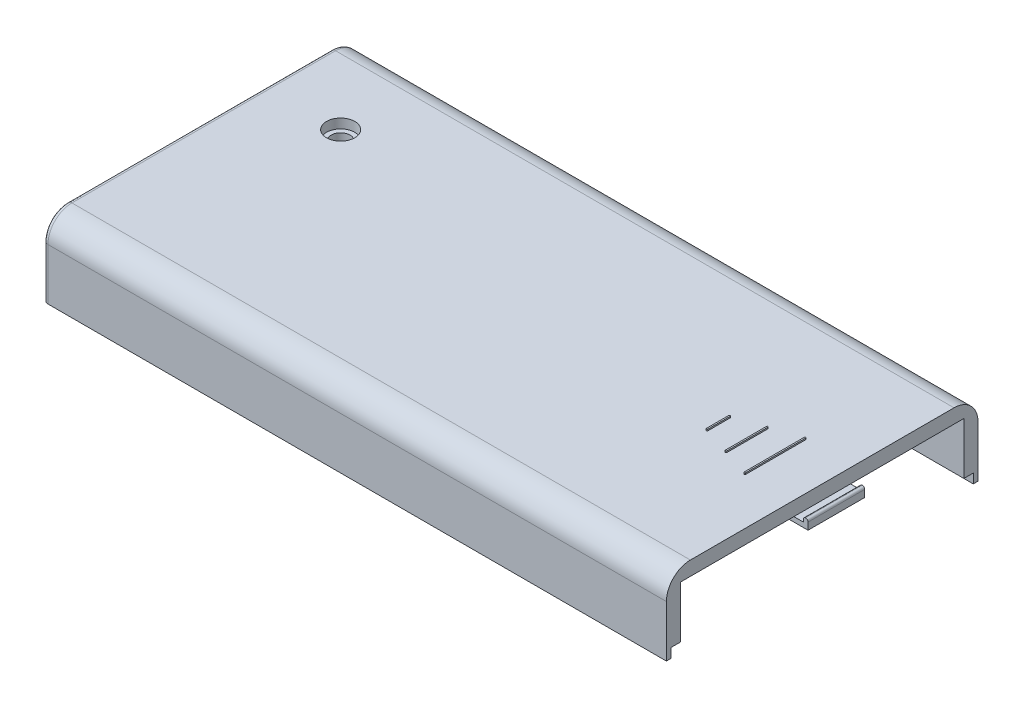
ISO-10303-21;
HEADER;
FILE_DESCRIPTION(('STEP AP214'),'2;1');
FILE_NAME('part.step','',(''),(''),'','','');
FILE_SCHEMA(('AUTOMOTIVE_DESIGN { 1 0 10303 214 1 1 1 1 }'));
ENDSEC;
DATA;
#1=APPLICATION_CONTEXT('core data for automotive mechanical design processes');
#2=APPLICATION_PROTOCOL_DEFINITION('international standard','automotive_design',2000,#1);
#3=PRODUCT_CONTEXT('',#1,'mechanical');
#4=PRODUCT('Part','Part','',(#3));
#5=PRODUCT_RELATED_PRODUCT_CATEGORY('part','',(#4));
#6=PRODUCT_DEFINITION_FORMATION('','',#4);
#7=PRODUCT_DEFINITION_CONTEXT('part definition',#1,'design');
#8=PRODUCT_DEFINITION('design','',#6,#7);
#9=PRODUCT_DEFINITION_SHAPE('','',#8);
#10=(LENGTH_UNIT() NAMED_UNIT(*) SI_UNIT(.MILLI.,.METRE.));
#11=(NAMED_UNIT(*) PLANE_ANGLE_UNIT() SI_UNIT($,.RADIAN.));
#12=(NAMED_UNIT(*) SI_UNIT($,.STERADIAN.) SOLID_ANGLE_UNIT());
#13=UNCERTAINTY_MEASURE_WITH_UNIT(LENGTH_MEASURE(1.E-05),#10,'distance_accuracy_value','');
#14=(GEOMETRIC_REPRESENTATION_CONTEXT(3) GLOBAL_UNCERTAINTY_ASSIGNED_CONTEXT((#13)) GLOBAL_UNIT_ASSIGNED_CONTEXT((#10,
#11,#12)) REPRESENTATION_CONTEXT('',''));
#15=CARTESIAN_POINT('',(0.,0.,0.));
#16=DIRECTION('',(0.,0.,1.));
#17=DIRECTION('',(1.,0.,0.));
#18=AXIS2_PLACEMENT_3D('',#15,#16,#17);
#19=CARTESIAN_POINT('',(-24.9939019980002,-9.0000000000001,-6.997192));
#20=DIRECTION('',(0.,1.,0.));
#21=DIRECTION('',(-1.,0.,0.));
#22=AXIS2_PLACEMENT_3D('',#19,#20,#21);
#23=CYLINDRICAL_SURFACE('',#22,1.);
#24=CARTESIAN_POINT('',(-24.9939019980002,2.99999999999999,-6.997192));
#25=DIRECTION('',(0.,1.,0.));
#26=DIRECTION('',(-1.,0.,0.));
#27=AXIS2_PLACEMENT_3D('',#24,#25,#26);
#28=CIRCLE('',#27,1.);
#29=CARTESIAN_POINT('',(-25.9939019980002,2.99999999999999,-6.997192));
#30=VERTEX_POINT('',#29);
#31=EDGE_CURVE('E396',#30,#30,#28,.T.);
#32=ORIENTED_EDGE('',*,*,#31,.T.);
#33=EDGE_LOOP('',(#32));
#34=FACE_BOUND('',#33,.T.);
#35=CARTESIAN_POINT('',(-24.9939019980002,1.49999999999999,-6.997192));
#36=DIRECTION('',(0.,-1.,0.));
#37=DIRECTION('',(1.,0.,0.));
#38=AXIS2_PLACEMENT_3D('',#35,#36,#37);
#39=CIRCLE('',#38,1.);
#40=CARTESIAN_POINT('',(-23.9939019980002,1.49999999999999,-6.997192));
#41=VERTEX_POINT('',#40);
#42=EDGE_CURVE('E387',#41,#41,#39,.F.);
#43=ORIENTED_EDGE('',*,*,#42,.F.);
#44=EDGE_LOOP('',(#43));
#45=FACE_BOUND('',#44,.T.);
#46=ADVANCED_FACE('F45',(#34,#45),#23,.F.);
#47=CARTESIAN_POINT('',(-32.4939020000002,3.99999999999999,16.4973));
#48=DIRECTION('',(0.,-1.,0.));
#49=DIRECTION('',(1.,0.,0.));
#50=AXIS2_PLACEMENT_3D('',#47,#48,#49);
#51=PLANE('',#50);
#52=CARTESIAN_POINT('',(-24.9939019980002,3.99999999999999,-6.997192));
#53=DIRECTION('',(0.,1.,0.));
#54=DIRECTION('',(-1.,0.,0.));
#55=AXIS2_PLACEMENT_3D('',#52,#53,#54);
#56=CIRCLE('',#55,1.5);
#57=CARTESIAN_POINT('',(-26.4939019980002,3.99999999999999,-6.997192));
#58=VERTEX_POINT('',#57);
#59=EDGE_CURVE('E393',#58,#58,#56,.T.);
#60=ORIENTED_EDGE('',*,*,#59,.F.);
#61=EDGE_LOOP('',(#60));
#62=FACE_BOUND('',#61,.T.);
#63=CARTESIAN_POINT('',(24.993902,4.00000000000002,-2.17499999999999));
#64=DIRECTION('',(0.,1.,0.));
#65=DIRECTION('',(-1.,0.,0.));
#66=AXIS2_PLACEMENT_3D('',#63,#64,#65);
#67=CIRCLE('',#66,0.0750000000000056);
#68=CARTESIAN_POINT('',(25.068902,4.00000000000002,-2.17499999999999));
#69=VERTEX_POINT('',#68);
#70=CARTESIAN_POINT('',(24.918902,4.00000000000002,-2.17499999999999));
#71=VERTEX_POINT('',#70);
#72=EDGE_CURVE('E437',#69,#71,#67,.T.);
#73=ORIENTED_EDGE('',*,*,#72,.F.);
#74=DIRECTION('',(0.,0.,-1.));
#75=VECTOR('',#74,1.);
#76=CARTESIAN_POINT('',(25.068902,4.00000000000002,-2.17499999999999));
#77=LINE('',#76,#75);
#78=CARTESIAN_POINT('',(25.068902,4.00000000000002,2.17499999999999));
#79=VERTEX_POINT('',#78);
#80=EDGE_CURVE('E442',#79,#69,#77,.T.);
#81=ORIENTED_EDGE('',*,*,#80,.F.);
#82=CARTESIAN_POINT('',(24.993902,4.00000000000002,2.175));
#83=DIRECTION('',(0.,1.,0.));
#84=DIRECTION('',(-1.,0.,0.));
#85=AXIS2_PLACEMENT_3D('',#82,#83,#84);
#86=CIRCLE('',#85,0.0750000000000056);
#87=CARTESIAN_POINT('',(24.918902,4.00000000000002,2.17499999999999));
#88=VERTEX_POINT('',#87);
#89=EDGE_CURVE('E454',#88,#79,#86,.T.);
#90=ORIENTED_EDGE('',*,*,#89,.F.);
#91=DIRECTION('',(0.,0.,1.));
#92=VECTOR('',#91,1.);
#93=CARTESIAN_POINT('',(24.918902,4.00000000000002,-2.17499999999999));
#94=LINE('',#93,#92);
#95=EDGE_CURVE('E451',#71,#88,#94,.T.);
#96=ORIENTED_EDGE('',*,*,#95,.F.);
#97=EDGE_LOOP('',(#73,#81,#90,#96));
#98=FACE_BOUND('',#97,.T.);
#99=DIRECTION('',(0.,0.,-1.));
#100=VECTOR('',#99,1.);
#101=CARTESIAN_POINT('',(32.993902,4.00000000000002,16.4973));
#102=LINE('',#101,#100);
#103=CARTESIAN_POINT('',(32.993902,4.00000000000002,13.9573));
#104=VERTEX_POINT('',#103);
#105=CARTESIAN_POINT('',(32.993902,4.00000000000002,-13.9573));
#106=VERTEX_POINT('',#105);
#107=EDGE_CURVE('E658',#104,#106,#102,.T.);
#108=ORIENTED_EDGE('',*,*,#107,.T.);
#109=DIRECTION('',(-1.,0.,0.));
#110=VECTOR('',#109,1.);
#111=CARTESIAN_POINT('',(-32.4939020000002,3.99999999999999,-13.9573));
#112=LINE('',#111,#110);
#113=CARTESIAN_POINT('',(-32.4939020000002,3.99999999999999,-13.9573));
#114=VERTEX_POINT('',#113);
#115=EDGE_CURVE('E663',#106,#114,#112,.T.);
#116=ORIENTED_EDGE('',*,*,#115,.T.);
#117=DIRECTION('',(0.,0.,-1.));
#118=VECTOR('',#117,1.);
#119=CARTESIAN_POINT('',(-32.4939020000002,3.99999999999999,16.4973));
#120=LINE('',#119,#118);
#121=CARTESIAN_POINT('',(-32.4939020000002,3.99999999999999,13.9573));
#122=VERTEX_POINT('',#121);
#123=EDGE_CURVE('E655',#122,#114,#120,.T.);
#124=ORIENTED_EDGE('',*,*,#123,.F.);
#125=DIRECTION('',(-1.,0.,0.));
#126=VECTOR('',#125,1.);
#127=CARTESIAN_POINT('',(32.993902,4.00000000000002,13.9573));
#128=LINE('',#127,#126);
#129=EDGE_CURVE('E661',#122,#104,#128,.F.);
#130=ORIENTED_EDGE('',*,*,#129,.T.);
#131=EDGE_LOOP('',(#108,#116,#124,#130));
#132=FACE_BOUND('',#131,.T.);
#133=CARTESIAN_POINT('',(27.993902,4.00000000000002,3.17499999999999));
#134=DIRECTION('',(0.,1.,0.));
#135=DIRECTION('',(-1.,0.,0.));
#136=AXIS2_PLACEMENT_3D('',#133,#134,#135);
#137=CIRCLE('',#136,0.0750000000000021);
#138=CARTESIAN_POINT('',(27.918902,4.00000000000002,3.17499999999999));
#139=VERTEX_POINT('',#138);
#140=CARTESIAN_POINT('',(28.068902,4.00000000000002,3.175));
#141=VERTEX_POINT('',#140);
#142=EDGE_CURVE('E470',#139,#141,#137,.T.);
#143=ORIENTED_EDGE('',*,*,#142,.F.);
#144=DIRECTION('',(0.,0.,1.));
#145=VECTOR('',#144,1.);
#146=CARTESIAN_POINT('',(27.918902,4.00000000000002,3.17499999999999));
#147=LINE('',#146,#145);
#148=CARTESIAN_POINT('',(27.918902,4.00000000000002,-3.17499999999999));
#149=VERTEX_POINT('',#148);
#150=EDGE_CURVE('E475',#149,#139,#147,.T.);
#151=ORIENTED_EDGE('',*,*,#150,.F.);
#152=CARTESIAN_POINT('',(27.993902,4.00000000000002,-3.175));
#153=DIRECTION('',(0.,1.,0.));
#154=DIRECTION('',(-1.,0.,0.));
#155=AXIS2_PLACEMENT_3D('',#152,#153,#154);
#156=CIRCLE('',#155,0.0750000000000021);
#157=CARTESIAN_POINT('',(28.068902,4.00000000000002,-3.175));
#158=VERTEX_POINT('',#157);
#159=EDGE_CURVE('E487',#158,#149,#156,.T.);
#160=ORIENTED_EDGE('',*,*,#159,.F.);
#161=DIRECTION('',(0.,0.,-1.));
#162=VECTOR('',#161,1.);
#163=CARTESIAN_POINT('',(28.068902,4.00000000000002,3.17499999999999));
#164=LINE('',#163,#162);
#165=EDGE_CURVE('E484',#141,#158,#164,.T.);
#166=ORIENTED_EDGE('',*,*,#165,.F.);
#167=EDGE_LOOP('',(#143,#151,#160,#166));
#168=FACE_BOUND('',#167,.T.);
#169=CARTESIAN_POINT('',(21.993902,4.00000000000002,-1.17499999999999));
#170=DIRECTION('',(0.,1.,0.));
#171=DIRECTION('',(-1.,0.,0.));
#172=AXIS2_PLACEMENT_3D('',#169,#170,#171);
#173=CIRCLE('',#172,0.0750000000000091);
#174=CARTESIAN_POINT('',(22.068902,4.00000000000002,-1.17499999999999));
#175=VERTEX_POINT('',#174);
#176=CARTESIAN_POINT('',(21.918902,4.00000000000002,-1.17499999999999));
#177=VERTEX_POINT('',#176);
#178=EDGE_CURVE('E402',#175,#177,#173,.T.);
#179=ORIENTED_EDGE('',*,*,#178,.F.);
#180=DIRECTION('',(0.,0.,-1.));
#181=VECTOR('',#180,1.);
#182=CARTESIAN_POINT('',(22.068902,4.00000000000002,-1.17499999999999));
#183=LINE('',#182,#181);
#184=CARTESIAN_POINT('',(22.068902,4.00000000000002,1.175));
#185=VERTEX_POINT('',#184);
#186=EDGE_CURVE('E409',#185,#175,#183,.T.);
#187=ORIENTED_EDGE('',*,*,#186,.F.);
#188=CARTESIAN_POINT('',(21.993902,4.00000000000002,1.175));
#189=DIRECTION('',(0.,1.,0.));
#190=DIRECTION('',(-1.,0.,0.));
#191=AXIS2_PLACEMENT_3D('',#188,#189,#190);
#192=CIRCLE('',#191,0.0750000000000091);
#193=CARTESIAN_POINT('',(21.918902,4.00000000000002,1.175));
#194=VERTEX_POINT('',#193);
#195=EDGE_CURVE('E421',#194,#185,#192,.T.);
#196=ORIENTED_EDGE('',*,*,#195,.F.);
#197=DIRECTION('',(0.,0.,1.));
#198=VECTOR('',#197,1.);
#199=CARTESIAN_POINT('',(21.918902,4.00000000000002,-1.17499999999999));
#200=LINE('',#199,#198);
#201=EDGE_CURVE('E418',#177,#194,#200,.T.);
#202=ORIENTED_EDGE('',*,*,#201,.F.);
#203=EDGE_LOOP('',(#179,#187,#196,#202));
#204=FACE_BOUND('',#203,.T.);
#205=ADVANCED_FACE('F787',(#62,#98,#132,#168,#204),#51,.F.);
#206=CARTESIAN_POINT('',(34.243902,2.74999999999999,3.));
#207=DIRECTION('',(0.,0.,-1.));
#208=DIRECTION('',(-1.,0.,0.));
#209=AXIS2_PLACEMENT_3D('',#206,#207,#208);
#210=CYLINDRICAL_SURFACE('',#209,0.25);
#211=DIRECTION('',(0.,0.,1.));
#212=VECTOR('',#211,1.);
#213=CARTESIAN_POINT('',(34.243902,2.99999999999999,3.));
#214=LINE('',#213,#212);
#215=CARTESIAN_POINT('',(34.243902,2.99999999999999,-3.));
#216=VERTEX_POINT('',#215);
#217=CARTESIAN_POINT('',(34.243902,2.99999999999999,3.));
#218=VERTEX_POINT('',#217);
#219=EDGE_CURVE('E711',#216,#218,#214,.T.);
#220=ORIENTED_EDGE('',*,*,#219,.T.);
#221=CARTESIAN_POINT('',(34.243902,2.74999999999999,3.));
#222=DIRECTION('',(0.,0.,-1.));
#223=DIRECTION('',(-1.,0.,0.));
#224=AXIS2_PLACEMENT_3D('',#221,#222,#223);
#225=CIRCLE('',#224,0.25);
#226=CARTESIAN_POINT('',(34.493902,2.74999999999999,3.));
#227=VERTEX_POINT('',#226);
#228=EDGE_CURVE('E53',#227,#218,#225,.F.);
#229=ORIENTED_EDGE('',*,*,#228,.F.);
#230=DIRECTION('',(0.,0.,-1.));
#231=VECTOR('',#230,1.);
#232=CARTESIAN_POINT('',(34.493902,2.74999999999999,3.));
#233=LINE('',#232,#231);
#234=CARTESIAN_POINT('',(34.493902,2.74999999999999,-3.));
#235=VERTEX_POINT('',#234);
#236=EDGE_CURVE('E722',#235,#227,#233,.F.);
#237=ORIENTED_EDGE('',*,*,#236,.F.);
#238=CARTESIAN_POINT('',(34.243902,2.74999999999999,-3.));
#239=DIRECTION('',(0.,0.,-1.));
#240=DIRECTION('',(-1.,0.,0.));
#241=AXIS2_PLACEMENT_3D('',#238,#239,#240);
#242=CIRCLE('',#241,0.25);
#243=EDGE_CURVE('E12',#216,#235,#242,.T.);
#244=ORIENTED_EDGE('',*,*,#243,.F.);
#245=EDGE_LOOP('',(#220,#229,#237,#244));
#246=FACE_BOUND('',#245,.T.);
#247=ADVANCED_FACE('F47',(#246),#210,.T.);
#248=CARTESIAN_POINT('',(34.243902,2.74999999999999,3.));
#249=DIRECTION('',(0.,0.,1.));
#250=DIRECTION('',(1.,0.,0.));
#251=AXIS2_PLACEMENT_3D('',#248,#249,#250);
#252=CYLINDRICAL_SURFACE('',#251,0.25);
#253=ORIENTED_EDGE('',*,*,#219,.F.);
#254=CARTESIAN_POINT('',(34.243902,2.74999999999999,-3.));
#255=DIRECTION('',(0.,0.,-1.));
#256=DIRECTION('',(-1.,0.,0.));
#257=AXIS2_PLACEMENT_3D('',#254,#255,#256);
#258=CIRCLE('',#257,0.25);
#259=CARTESIAN_POINT('',(33.993902,2.74999999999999,-3.));
#260=VERTEX_POINT('',#259);
#261=EDGE_CURVE('E717',#260,#216,#258,.T.);
#262=ORIENTED_EDGE('',*,*,#261,.F.);
#263=DIRECTION('',(0.,0.,1.));
#264=VECTOR('',#263,1.);
#265=CARTESIAN_POINT('',(33.993902,2.74999999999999,3.));
#266=LINE('',#265,#264);
#267=CARTESIAN_POINT('',(33.993902,2.74999999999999,3.));
#268=VERTEX_POINT('',#267);
#269=EDGE_CURVE('E714',#268,#260,#266,.F.);
#270=ORIENTED_EDGE('',*,*,#269,.F.);
#271=CARTESIAN_POINT('',(34.243902,2.74999999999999,3.));
#272=DIRECTION('',(0.,0.,-1.));
#273=DIRECTION('',(-1.,0.,0.));
#274=AXIS2_PLACEMENT_3D('',#271,#272,#273);
#275=CIRCLE('',#274,0.25);
#276=EDGE_CURVE('E720',#218,#268,#275,.F.);
#277=ORIENTED_EDGE('',*,*,#276,.F.);
#278=EDGE_LOOP('',(#253,#262,#270,#277));
#279=FACE_BOUND('',#278,.T.);
#280=ADVANCED_FACE('F733',(#279),#252,.T.);
#281=CARTESIAN_POINT('',(-32.4939020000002,2.49999999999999,16.4973));
#282=DIRECTION('',(0.,-1.,0.));
#283=DIRECTION('',(1.,0.,0.));
#284=AXIS2_PLACEMENT_3D('',#281,#282,#283);
#285=PLANE('',#284);
#286=CARTESIAN_POINT('',(-24.9939019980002,2.49999999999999,-6.997192));
#287=DIRECTION('',(0.,-1.,0.));
#288=DIRECTION('',(1.,0.,0.));
#289=AXIS2_PLACEMENT_3D('',#286,#287,#288);
#290=CIRCLE('',#289,3.5);
#291=CARTESIAN_POINT('',(-21.4939019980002,2.49999999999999,-6.997192));
#292=VERTEX_POINT('',#291);
#293=EDGE_CURVE('E371',#292,#292,#290,.T.);
#294=ORIENTED_EDGE('',*,*,#293,.F.);
#295=EDGE_LOOP('',(#294));
#296=FACE_BOUND('',#295,.T.);
#297=DIRECTION('',(0.,0.,-1.));
#298=VECTOR('',#297,1.);
#299=CARTESIAN_POINT('',(28.993902,2.49999999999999,3.));
#300=LINE('',#299,#298);
#301=CARTESIAN_POINT('',(28.9939019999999,2.50000000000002,3.));
#302=VERTEX_POINT('',#301);
#303=CARTESIAN_POINT('',(28.993902,2.50000000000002,-3.));
#304=VERTEX_POINT('',#303);
#305=EDGE_CURVE('E518',#302,#304,#300,.T.);
#306=ORIENTED_EDGE('',*,*,#305,.F.);
#307=DIRECTION('',(1.,0.,0.));
#308=VECTOR('',#307,1.);
#309=CARTESIAN_POINT('',(-32.4939020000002,2.49999999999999,3.));
#310=LINE('',#309,#308);
#311=CARTESIAN_POINT('',(32.993902,2.50000000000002,3.));
#312=VERTEX_POINT('',#311);
#313=EDGE_CURVE('E709',#302,#312,#310,.T.);
#314=ORIENTED_EDGE('',*,*,#313,.T.);
#315=DIRECTION('',(0.,0.,-1.));
#316=VECTOR('',#315,1.);
#317=CARTESIAN_POINT('',(32.993902,2.50000000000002,14.9973));
#318=LINE('',#317,#316);
#319=CARTESIAN_POINT('',(32.993902,2.50000000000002,14.9973));
#320=VERTEX_POINT('',#319);
#321=EDGE_CURVE('E626',#320,#312,#318,.T.);
#322=ORIENTED_EDGE('',*,*,#321,.F.);
#323=DIRECTION('',(1.,0.,0.));
#324=VECTOR('',#323,1.);
#325=CARTESIAN_POINT('',(-31.4939020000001,2.49999999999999,14.9973));
#326=LINE('',#325,#324);
#327=CARTESIAN_POINT('',(-31.4939020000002,2.49999999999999,14.9973));
#328=VERTEX_POINT('',#327);
#329=EDGE_CURVE('E606',#328,#320,#326,.T.);
#330=ORIENTED_EDGE('',*,*,#329,.F.);
#331=DIRECTION('',(0.,0.,1.));
#332=VECTOR('',#331,1.);
#333=CARTESIAN_POINT('',(-31.4939020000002,2.49999999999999,-14.9973));
#334=LINE('',#333,#332);
#335=CARTESIAN_POINT('',(-31.4939020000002,2.49999999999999,-14.9973));
#336=VERTEX_POINT('',#335);
#337=EDGE_CURVE('E608',#336,#328,#334,.T.);
#338=ORIENTED_EDGE('',*,*,#337,.F.);
#339=DIRECTION('',(-1.,0.,0.));
#340=VECTOR('',#339,1.);
#341=CARTESIAN_POINT('',(32.993902,2.50000000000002,-14.9973));
#342=LINE('',#341,#340);
#343=CARTESIAN_POINT('',(32.993902,2.50000000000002,-14.9973));
#344=VERTEX_POINT('',#343);
#345=EDGE_CURVE('E611',#344,#336,#342,.T.);
#346=ORIENTED_EDGE('',*,*,#345,.F.);
#347=CARTESIAN_POINT('',(32.993902,2.49999999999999,-3.));
#348=VERTEX_POINT('',#347);
#349=EDGE_CURVE('E613',#348,#344,#318,.T.);
#350=ORIENTED_EDGE('',*,*,#349,.F.);
#351=DIRECTION('',(1.,0.,0.));
#352=VECTOR('',#351,1.);
#353=CARTESIAN_POINT('',(-32.4939020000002,2.49999999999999,-3.));
#354=LINE('',#353,#352);
#355=EDGE_CURVE('E702',#304,#348,#354,.T.);
#356=ORIENTED_EDGE('',*,*,#355,.F.);
#357=EDGE_LOOP('',(#306,#314,#322,#330,#338,#346,#350,#356));
#358=FACE_BOUND('',#357,.T.);
#359=ADVANCED_FACE('F757',(#296,#358),#285,.T.);
#360=CARTESIAN_POINT('',(-32.9939020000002,-4.00000000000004,16.4973));
#361=DIRECTION('',(0.,1.,0.));
#362=DIRECTION('',(0.,0.,1.));
#363=AXIS2_PLACEMENT_3D('',#360,#361,#362);
#364=PLANE('',#363);
#365=DIRECTION('',(0.,0.,-1.));
#366=VECTOR('',#365,1.);
#367=CARTESIAN_POINT('',(-31.4939020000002,-4.00000000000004,-14.9973));
#368=LINE('',#367,#366);
#369=CARTESIAN_POINT('',(-31.4939020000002,-4.00000000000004,2.5));
#370=VERTEX_POINT('',#369);
#371=CARTESIAN_POINT('',(-31.4939020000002,-4.00000000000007,-2.5));
#372=VERTEX_POINT('',#371);
#373=EDGE_CURVE('E617',#370,#372,#368,.T.);
#374=ORIENTED_EDGE('',*,*,#373,.F.);
#375=DIRECTION('',(-1.,0.,0.));
#376=VECTOR('',#375,1.);
#377=CARTESIAN_POINT('',(-22.0599208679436,-4.00000000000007,2.5));
#378=LINE('',#377,#376);
#379=CARTESIAN_POINT('',(-32.9939020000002,-4.00000000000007,2.5));
#380=VERTEX_POINT('',#379);
#381=EDGE_CURVE('E585',#370,#380,#378,.T.);
#382=ORIENTED_EDGE('',*,*,#381,.T.);
#383=DIRECTION('',(0.,0.,-1.));
#384=VECTOR('',#383,1.);
#385=CARTESIAN_POINT('',(-32.9939020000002,-4.00000000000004,16.4973));
#386=LINE('',#385,#384);
#387=CARTESIAN_POINT('',(-32.9939020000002,-4.00000000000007,-2.5));
#388=VERTEX_POINT('',#387);
#389=EDGE_CURVE('E652',#380,#388,#386,.T.);
#390=ORIENTED_EDGE('',*,*,#389,.T.);
#391=DIRECTION('',(-1.,0.,0.));
#392=VECTOR('',#391,1.);
#393=CARTESIAN_POINT('',(-22.0599208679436,-4.00000000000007,-2.5));
#394=LINE('',#393,#392);
#395=EDGE_CURVE('E601',#372,#388,#394,.T.);
#396=ORIENTED_EDGE('',*,*,#395,.F.);
#397=EDGE_LOOP('',(#374,#382,#390,#396));
#398=FACE_BOUND('',#397,.T.);
#399=ADVANCED_FACE('F943',(#398),#364,.F.);
#400=DIRECTION('',(1.,0.,0.));
#401=VECTOR('',#400,1.);
#402=CARTESIAN_POINT('',(-32.9081155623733,-4.00000000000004,-15.9973));
#403=LINE('',#402,#401);
#404=CARTESIAN_POINT('',(-31.4939020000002,-4.00000000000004,-15.9973));
#405=VERTEX_POINT('',#404);
#406=CARTESIAN_POINT('',(32.993902,-4.00000000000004,-15.9973));
#407=VERTEX_POINT('',#406);
#408=EDGE_CURVE('E374',#405,#407,#403,.T.);
#409=ORIENTED_EDGE('',*,*,#408,.F.);
#410=CARTESIAN_POINT('',(-31.4939020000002,-4.00000000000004,-3.99999999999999));
#411=VERTEX_POINT('',#410);
#412=EDGE_CURVE('E605',#411,#405,#368,.T.);
#413=ORIENTED_EDGE('',*,*,#412,.F.);
#414=DIRECTION('',(-1.,0.,0.));
#415=VECTOR('',#414,1.);
#416=CARTESIAN_POINT('',(-22.0599208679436,-4.00000000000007,-3.99999999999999));
#417=LINE('',#416,#415);
#418=CARTESIAN_POINT('',(-32.9939020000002,-4.00000000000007,-3.99999999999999));
#419=VERTEX_POINT('',#418);
#420=EDGE_CURVE('E598',#411,#419,#417,.T.);
#421=ORIENTED_EDGE('',*,*,#420,.T.);
#422=CARTESIAN_POINT('',(-32.9939020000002,-4.00000000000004,-15.9973));
#423=VERTEX_POINT('',#422);
#424=EDGE_CURVE('E647',#419,#423,#386,.T.);
#425=ORIENTED_EDGE('',*,*,#424,.T.);
#426=CARTESIAN_POINT('',(-32.4939020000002,-4.00000000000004,-15.9973));
#427=DIRECTION('',(0.,1.,0.));
#428=DIRECTION('',(0.,0.,1.));
#429=AXIS2_PLACEMENT_3D('',#426,#427,#428);
#430=CIRCLE('',#429,0.5);
#431=CARTESIAN_POINT('',(-32.4939020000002,-4.00000000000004,-16.4973));
#432=VERTEX_POINT('',#431);
#433=EDGE_CURVE('E696',#423,#432,#430,.F.);
#434=ORIENTED_EDGE('',*,*,#433,.T.);
#435=DIRECTION('',(1.,0.,0.));
#436=VECTOR('',#435,1.);
#437=CARTESIAN_POINT('',(-32.9939020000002,-4.00000000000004,-16.4973));
#438=LINE('',#437,#436);
#439=CARTESIAN_POINT('',(32.993902,-4.00000000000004,-16.4973));
#440=VERTEX_POINT('',#439);
#441=EDGE_CURVE('E635',#432,#440,#438,.T.);
#442=ORIENTED_EDGE('',*,*,#441,.T.);
#443=DIRECTION('',(0.,0.,-1.));
#444=VECTOR('',#443,1.);
#445=CARTESIAN_POINT('',(32.993902,-4.00000000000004,16.4973));
#446=LINE('',#445,#444);
#447=EDGE_CURVE('E637',#407,#440,#446,.T.);
#448=ORIENTED_EDGE('',*,*,#447,.F.);
#449=EDGE_LOOP('',(#409,#413,#421,#425,#434,#442,#448));
#450=FACE_BOUND('',#449,.T.);
#451=ADVANCED_FACE('F769',(#450),#364,.F.);
#452=CARTESIAN_POINT('',(32.993902,4.00000000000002,16.4973));
#453=DIRECTION('',(-1.,0.,0.));
#454=DIRECTION('',(0.,0.,1.));
#455=AXIS2_PLACEMENT_3D('',#452,#453,#454);
#456=PLANE('',#455);
#457=DIRECTION('',(0.,-1.,0.));
#458=VECTOR('',#457,1.);
#459=CARTESIAN_POINT('',(32.993902,-4.00000000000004,15.9973));
#460=LINE('',#459,#458);
#461=CARTESIAN_POINT('',(32.993902,-3.00000000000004,15.9973));
#462=VERTEX_POINT('',#461);
#463=CARTESIAN_POINT('',(32.993902,-4.00000000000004,15.9973));
#464=VERTEX_POINT('',#463);
#465=EDGE_CURVE('E363',#462,#464,#460,.T.);
#466=ORIENTED_EDGE('',*,*,#465,.F.);
#467=DIRECTION('',(0.,0.,1.));
#468=VECTOR('',#467,1.);
#469=CARTESIAN_POINT('',(32.993902,-3.00000000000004,14.9973));
#470=LINE('',#469,#468);
#471=CARTESIAN_POINT('',(32.993902,-3.00000000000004,14.9973));
#472=VERTEX_POINT('',#471);
#473=EDGE_CURVE('E355',#472,#462,#470,.T.);
#474=ORIENTED_EDGE('',*,*,#473,.F.);
#475=DIRECTION('',(0.,-1.,0.));
#476=VECTOR('',#475,1.);
#477=CARTESIAN_POINT('',(32.993902,75.1220984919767,14.9973));
#478=LINE('',#477,#476);
#479=EDGE_CURVE('E621',#320,#472,#478,.T.);
#480=ORIENTED_EDGE('',*,*,#479,.F.);
#481=ORIENTED_EDGE('',*,*,#321,.T.);
#482=EDGE_CURVE('E630',#312,#348,#318,.T.);
#483=ORIENTED_EDGE('',*,*,#482,.T.);
#484=ORIENTED_EDGE('',*,*,#349,.T.);
#485=DIRECTION('',(0.,-1.,0.));
#486=VECTOR('',#485,1.);
#487=CARTESIAN_POINT('',(32.993902,75.1220984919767,-14.9973));
#488=LINE('',#487,#486);
#489=CARTESIAN_POINT('',(32.993902,-3.00000000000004,-14.9973));
#490=VERTEX_POINT('',#489);
#491=EDGE_CURVE('E616',#344,#490,#488,.T.);
#492=ORIENTED_EDGE('',*,*,#491,.T.);
#493=DIRECTION('',(0.,0.,1.));
#494=VECTOR('',#493,1.);
#495=CARTESIAN_POINT('',(32.993902,-3.00000000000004,-14.9973));
#496=LINE('',#495,#494);
#497=CARTESIAN_POINT('',(32.993902,-3.00000000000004,-15.9973));
#498=VERTEX_POINT('',#497);
#499=EDGE_CURVE('E372',#498,#490,#496,.T.);
#500=ORIENTED_EDGE('',*,*,#499,.F.);
#501=DIRECTION('',(0.,1.,0.));
#502=VECTOR('',#501,1.);
#503=CARTESIAN_POINT('',(32.993902,-4.00000000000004,-15.9973));
#504=LINE('',#503,#502);
#505=EDGE_CURVE('E375',#407,#498,#504,.T.);
#506=ORIENTED_EDGE('',*,*,#505,.F.);
#507=ORIENTED_EDGE('',*,*,#447,.T.);
#508=DIRECTION('',(0.,1.,0.));
#509=VECTOR('',#508,1.);
#510=CARTESIAN_POINT('',(32.993902,4.00000000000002,-16.4973));
#511=LINE('',#510,#509);
#512=CARTESIAN_POINT('',(32.993902,1.46000000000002,-16.4973));
#513=VERTEX_POINT('',#512);
#514=EDGE_CURVE('E638',#440,#513,#511,.T.);
#515=ORIENTED_EDGE('',*,*,#514,.T.);
#516=CARTESIAN_POINT('',(32.993902,1.46000000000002,-13.9573));
#517=DIRECTION('',(-1.,0.,0.));
#518=DIRECTION('',(0.,0.,1.));
#519=AXIS2_PLACEMENT_3D('',#516,#517,#518);
#520=CIRCLE('',#519,2.54);
#521=EDGE_CURVE('E670',#513,#106,#520,.F.);
#522=ORIENTED_EDGE('',*,*,#521,.T.);
#523=ORIENTED_EDGE('',*,*,#107,.F.);
#524=CARTESIAN_POINT('',(32.993902,1.46000000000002,13.9573));
#525=DIRECTION('',(-1.,0.,0.));
#526=DIRECTION('',(0.,0.,1.));
#527=AXIS2_PLACEMENT_3D('',#524,#525,#526);
#528=CIRCLE('',#527,2.54);
#529=CARTESIAN_POINT('',(32.993902,1.46000000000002,16.4973));
#530=VERTEX_POINT('',#529);
#531=EDGE_CURVE('E668',#104,#530,#528,.F.);
#532=ORIENTED_EDGE('',*,*,#531,.T.);
#533=DIRECTION('',(0.,1.,0.));
#534=VECTOR('',#533,1.);
#535=CARTESIAN_POINT('',(32.993902,4.00000000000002,16.4973));
#536=LINE('',#535,#534);
#537=CARTESIAN_POINT('',(32.993902,-4.00000000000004,16.4973));
#538=VERTEX_POINT('',#537);
#539=EDGE_CURVE('E631',#538,#530,#536,.T.);
#540=ORIENTED_EDGE('',*,*,#539,.F.);
#541=EDGE_CURVE('E644',#538,#464,#446,.T.);
#542=ORIENTED_EDGE('',*,*,#541,.T.);
#543=EDGE_LOOP('',(#466,#474,#480,#481,#483,#484,#492,#500,#506,#507,#515,#522,#523,#532,#540,#542));
#544=FACE_BOUND('',#543,.T.);
#545=ADVANCED_FACE('F752',(#544),#456,.F.);
#546=CARTESIAN_POINT('',(-32.4939020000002,3.49999999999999,16.4973));
#547=DIRECTION('',(0.,0.,-1.));
#548=DIRECTION('',(-1.,0.,0.));
#549=AXIS2_PLACEMENT_3D('',#546,#547,#548);
#550=CYLINDRICAL_SURFACE('',#549,0.5);
#551=ORIENTED_EDGE('',*,*,#123,.T.);
#552=CARTESIAN_POINT('',(-32.4939020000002,3.49999999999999,-13.9573));
#553=DIRECTION('',(0.,0.,-1.));
#554=DIRECTION('',(-1.,0.,0.));
#555=AXIS2_PLACEMENT_3D('',#552,#553,#554);
#556=CIRCLE('',#555,0.5);
#557=CARTESIAN_POINT('',(-32.9939020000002,3.49999999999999,-13.9573));
#558=VERTEX_POINT('',#557);
#559=EDGE_CURVE('E678',#114,#558,#556,.F.);
#560=ORIENTED_EDGE('',*,*,#559,.T.);
#561=DIRECTION('',(0.,0.,-1.));
#562=VECTOR('',#561,1.);
#563=CARTESIAN_POINT('',(-32.9939020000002,3.49999999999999,16.4973));
#564=LINE('',#563,#562);
#565=CARTESIAN_POINT('',(-32.9939020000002,3.49999999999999,13.9573));
#566=VERTEX_POINT('',#565);
#567=EDGE_CURVE('E651',#566,#558,#564,.T.);
#568=ORIENTED_EDGE('',*,*,#567,.F.);
#569=CARTESIAN_POINT('',(-32.4939020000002,3.49999999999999,13.9573));
#570=DIRECTION('',(0.,0.,-1.));
#571=DIRECTION('',(-1.,0.,0.));
#572=AXIS2_PLACEMENT_3D('',#569,#570,#571);
#573=CIRCLE('',#572,0.5);
#574=EDGE_CURVE('E675',#566,#122,#573,.T.);
#575=ORIENTED_EDGE('',*,*,#574,.T.);
#576=EDGE_LOOP('',(#551,#560,#568,#575));
#577=FACE_BOUND('',#576,.T.);
#578=ADVANCED_FACE('F792',(#577),#550,.T.);
#579=CARTESIAN_POINT('',(-32.9939020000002,3.49999999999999,16.4973));
#580=DIRECTION('',(1.,0.,0.));
#581=DIRECTION('',(0.,1.,0.));
#582=AXIS2_PLACEMENT_3D('',#579,#580,#581);
#583=PLANE('',#582);
#584=ORIENTED_EDGE('',*,*,#389,.F.);
#585=DIRECTION('',(0.,-1.,0.));
#586=VECTOR('',#585,1.);
#587=CARTESIAN_POINT('',(-32.9939020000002,-7.00000000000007,2.5));
#588=LINE('',#587,#586);
#589=CARTESIAN_POINT('',(-32.9939020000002,-7.00000000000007,2.5));
#590=VERTEX_POINT('',#589);
#591=EDGE_CURVE('E580',#380,#590,#588,.T.);
#592=ORIENTED_EDGE('',*,*,#591,.T.);
#593=DIRECTION('',(0.,0.,-1.));
#594=VECTOR('',#593,1.);
#595=CARTESIAN_POINT('',(-32.9939020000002,-7.00000000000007,-2.5));
#596=LINE('',#595,#594);
#597=CARTESIAN_POINT('',(-32.9939020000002,-7.00000000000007,-2.5));
#598=VERTEX_POINT('',#597);
#599=EDGE_CURVE('E541',#590,#598,#596,.T.);
#600=ORIENTED_EDGE('',*,*,#599,.T.);
#601=DIRECTION('',(0.,1.,0.));
#602=VECTOR('',#601,1.);
#603=CARTESIAN_POINT('',(-32.9939020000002,-4.00000000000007,-2.5));
#604=LINE('',#603,#602);
#605=EDGE_CURVE('E562',#598,#388,#604,.T.);
#606=ORIENTED_EDGE('',*,*,#605,.T.);
#607=EDGE_LOOP('',(#584,#592,#600,#606));
#608=FACE_BOUND('',#607,.T.);
#609=ORIENTED_EDGE('',*,*,#567,.T.);
#610=CARTESIAN_POINT('',(-32.9939020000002,1.45999999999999,-13.9573));
#611=DIRECTION('',(1.,0.,0.));
#612=DIRECTION('',(0.,1.,0.));
#613=AXIS2_PLACEMENT_3D('',#610,#611,#612);
#614=CIRCLE('',#613,2.04);
#615=CARTESIAN_POINT('',(-32.9939020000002,1.45999999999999,-15.9973));
#616=VERTEX_POINT('',#615);
#617=EDGE_CURVE('E688',#558,#616,#614,.F.);
#618=ORIENTED_EDGE('',*,*,#617,.T.);
#619=DIRECTION('',(0.,-1.,0.));
#620=VECTOR('',#619,1.);
#621=CARTESIAN_POINT('',(-32.9939020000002,3.49999999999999,-15.9973));
#622=LINE('',#621,#620);
#623=EDGE_CURVE('E685',#616,#423,#622,.T.);
#624=ORIENTED_EDGE('',*,*,#623,.T.);
#625=ORIENTED_EDGE('',*,*,#424,.F.);
#626=DIRECTION('',(0.,-1.,0.));
#627=VECTOR('',#626,1.);
#628=CARTESIAN_POINT('',(-32.9939020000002,-8.00000000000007,-3.99999999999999));
#629=LINE('',#628,#627);
#630=CARTESIAN_POINT('',(-32.9939020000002,-8.00000000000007,-3.99999999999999));
#631=VERTEX_POINT('',#630);
#632=EDGE_CURVE('E565',#419,#631,#629,.T.);
#633=ORIENTED_EDGE('',*,*,#632,.T.);
#634=CARTESIAN_POINT('',(-32.9939020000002,-8.00000000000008,-3.));
#635=DIRECTION('',(-1.,0.,0.));
#636=DIRECTION('',(0.,0.,-1.));
#637=AXIS2_PLACEMENT_3D('',#634,#635,#636);
#638=CIRCLE('',#637,0.999999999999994);
#639=CARTESIAN_POINT('',(-32.9939020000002,-9.00000000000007,-3.));
#640=VERTEX_POINT('',#639);
#641=EDGE_CURVE('E568',#631,#640,#638,.T.);
#642=ORIENTED_EDGE('',*,*,#641,.T.);
#643=DIRECTION('',(0.,0.,1.));
#644=VECTOR('',#643,1.);
#645=CARTESIAN_POINT('',(-32.9939020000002,-9.00000000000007,3.));
#646=LINE('',#645,#644);
#647=CARTESIAN_POINT('',(-32.9939020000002,-9.00000000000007,3.));
#648=VERTEX_POINT('',#647);
#649=EDGE_CURVE('E571',#640,#648,#646,.T.);
#650=ORIENTED_EDGE('',*,*,#649,.T.);
#651=CARTESIAN_POINT('',(-32.9939020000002,-8.00000000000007,3.00000000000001));
#652=DIRECTION('',(-1.,0.,0.));
#653=DIRECTION('',(0.,0.,-1.));
#654=AXIS2_PLACEMENT_3D('',#651,#652,#653);
#655=CIRCLE('',#654,0.999999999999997);
#656=CARTESIAN_POINT('',(-32.9939020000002,-8.00000000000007,4.));
#657=VERTEX_POINT('',#656);
#658=EDGE_CURVE('E574',#648,#657,#655,.T.);
#659=ORIENTED_EDGE('',*,*,#658,.T.);
#660=DIRECTION('',(0.,1.,0.));
#661=VECTOR('',#660,1.);
#662=CARTESIAN_POINT('',(-32.9939020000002,-4.00000000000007,4.));
#663=LINE('',#662,#661);
#664=CARTESIAN_POINT('',(-32.9939020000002,-4.00000000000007,4.));
#665=VERTEX_POINT('',#664);
#666=EDGE_CURVE('E577',#657,#665,#663,.T.);
#667=ORIENTED_EDGE('',*,*,#666,.T.);
#668=CARTESIAN_POINT('',(-32.9939020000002,-4.00000000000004,15.9973));
#669=VERTEX_POINT('',#668);
#670=EDGE_CURVE('E648',#669,#665,#386,.T.);
#671=ORIENTED_EDGE('',*,*,#670,.F.);
#672=DIRECTION('',(0.,-1.,0.));
#673=VECTOR('',#672,1.);
#674=CARTESIAN_POINT('',(-32.9939020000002,1.45999999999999,15.9973));
#675=LINE('',#674,#673);
#676=CARTESIAN_POINT('',(-32.9939020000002,1.45999999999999,15.9973));
#677=VERTEX_POINT('',#676);
#678=EDGE_CURVE('E681',#669,#677,#675,.F.);
#679=ORIENTED_EDGE('',*,*,#678,.T.);
#680=CARTESIAN_POINT('',(-32.9939020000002,1.45999999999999,13.9573));
#681=DIRECTION('',(1.,0.,0.));
#682=DIRECTION('',(0.,1.,0.));
#683=AXIS2_PLACEMENT_3D('',#680,#681,#682);
#684=CIRCLE('',#683,2.04);
#685=EDGE_CURVE('E683',#677,#566,#684,.F.);
#686=ORIENTED_EDGE('',*,*,#685,.T.);
#687=EDGE_LOOP('',(#609,#618,#624,#625,#633,#642,#650,#659,#667,#671,#679,#686));
#688=FACE_BOUND('',#687,.T.);
#689=ADVANCED_FACE('F799',(#608,#688),#583,.F.);
#690=CARTESIAN_POINT('',(-31.4939020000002,-4.00000000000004,15.9973));
#691=VERTEX_POINT('',#690);
#692=CARTESIAN_POINT('',(-31.4939020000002,-4.00000000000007,4.));
#693=VERTEX_POINT('',#692);
#694=EDGE_CURVE('E614',#691,#693,#368,.T.);
#695=ORIENTED_EDGE('',*,*,#694,.F.);
#696=DIRECTION('',(1.,0.,0.));
#697=VECTOR('',#696,1.);
#698=CARTESIAN_POINT('',(-32.9081155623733,-4.00000000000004,15.9973));
#699=LINE('',#698,#697);
#700=EDGE_CURVE('E350',#691,#464,#699,.T.);
#701=ORIENTED_EDGE('',*,*,#700,.T.);
#702=ORIENTED_EDGE('',*,*,#541,.F.);
#703=DIRECTION('',(1.,0.,0.));
#704=VECTOR('',#703,1.);
#705=CARTESIAN_POINT('',(-32.9939020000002,-4.00000000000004,16.4973));
#706=LINE('',#705,#704);
#707=CARTESIAN_POINT('',(-32.4939020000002,-4.00000000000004,16.4973));
#708=VERTEX_POINT('',#707);
#709=EDGE_CURVE('E634',#708,#538,#706,.T.);
#710=ORIENTED_EDGE('',*,*,#709,.F.);
#711=CARTESIAN_POINT('',(-32.4939020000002,-4.00000000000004,15.9973));
#712=DIRECTION('',(0.,1.,0.));
#713=DIRECTION('',(0.,0.,1.));
#714=AXIS2_PLACEMENT_3D('',#711,#712,#713);
#715=CIRCLE('',#714,0.5);
#716=EDGE_CURVE('E694',#708,#669,#715,.F.);
#717=ORIENTED_EDGE('',*,*,#716,.T.);
#718=ORIENTED_EDGE('',*,*,#670,.T.);
#719=DIRECTION('',(-1.,0.,0.));
#720=VECTOR('',#719,1.);
#721=CARTESIAN_POINT('',(-22.0599208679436,-4.00000000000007,4.));
#722=LINE('',#721,#720);
#723=EDGE_CURVE('E588',#693,#665,#722,.T.);
#724=ORIENTED_EDGE('',*,*,#723,.F.);
#725=EDGE_LOOP('',(#695,#701,#702,#710,#717,#718,#724));
#726=FACE_BOUND('',#725,.T.);
#727=ADVANCED_FACE('F956',(#726),#364,.F.);
#728=CARTESIAN_POINT('',(-32.4939020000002,3.49999999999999,16.4973));
#729=DIRECTION('',(0.,0.,1.));
#730=DIRECTION('',(1.,0.,0.));
#731=AXIS2_PLACEMENT_3D('',#728,#729,#730);
#732=PLANE('',#731);
#733=DIRECTION('',(-1.,0.,0.));
#734=VECTOR('',#733,1.);
#735=CARTESIAN_POINT('',(-32.4939020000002,1.45999999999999,16.4973));
#736=LINE('',#735,#734);
#737=CARTESIAN_POINT('',(-32.4939020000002,1.45999999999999,16.4973));
#738=VERTEX_POINT('',#737);
#739=EDGE_CURVE('E672',#530,#738,#736,.T.);
#740=ORIENTED_EDGE('',*,*,#739,.T.);
#741=DIRECTION('',(0.,-1.,0.));
#742=VECTOR('',#741,1.);
#743=CARTESIAN_POINT('',(-32.4939020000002,-4.00000000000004,16.4973));
#744=LINE('',#743,#742);
#745=EDGE_CURVE('E700',#738,#708,#744,.T.);
#746=ORIENTED_EDGE('',*,*,#745,.T.);
#747=ORIENTED_EDGE('',*,*,#709,.T.);
#748=ORIENTED_EDGE('',*,*,#539,.T.);
#749=EDGE_LOOP('',(#740,#746,#747,#748));
#750=FACE_BOUND('',#749,.T.);
#751=ADVANCED_FACE('F953',(#750),#732,.T.);
#752=CARTESIAN_POINT('',(-32.4939020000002,3.49999999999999,-16.4973));
#753=DIRECTION('',(0.,0.,1.));
#754=DIRECTION('',(1.,0.,0.));
#755=AXIS2_PLACEMENT_3D('',#752,#753,#754);
#756=PLANE('',#755);
#757=ORIENTED_EDGE('',*,*,#441,.F.);
#758=DIRECTION('',(0.,-1.,0.));
#759=VECTOR('',#758,1.);
#760=CARTESIAN_POINT('',(-32.4939020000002,3.49999999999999,-16.4973));
#761=LINE('',#760,#759);
#762=CARTESIAN_POINT('',(-32.4939020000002,1.45999999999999,-16.4973));
#763=VERTEX_POINT('',#762);
#764=EDGE_CURVE('E698',#432,#763,#761,.F.);
#765=ORIENTED_EDGE('',*,*,#764,.T.);
#766=DIRECTION('',(-1.,0.,0.));
#767=VECTOR('',#766,1.);
#768=CARTESIAN_POINT('',(-32.4939020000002,1.45999999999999,-16.4973));
#769=LINE('',#768,#767);
#770=EDGE_CURVE('E666',#763,#513,#769,.F.);
#771=ORIENTED_EDGE('',*,*,#770,.T.);
#772=ORIENTED_EDGE('',*,*,#514,.F.);
#773=EDGE_LOOP('',(#757,#765,#771,#772));
#774=FACE_BOUND('',#773,.T.);
#775=ADVANCED_FACE('F776',(#774),#756,.F.);
#776=CARTESIAN_POINT('',(-32.4939020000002,1.45999999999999,-13.9573));
#777=DIRECTION('',(-1.,0.,0.));
#778=DIRECTION('',(0.,-1.,0.));
#779=AXIS2_PLACEMENT_3D('',#776,#777,#778);
#780=CYLINDRICAL_SURFACE('',#779,2.54);
#781=ORIENTED_EDGE('',*,*,#770,.F.);
#782=CARTESIAN_POINT('',(-32.4939020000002,1.45999999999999,-13.9573));
#783=DIRECTION('',(1.,0.,0.));
#784=DIRECTION('',(0.,1.,0.));
#785=AXIS2_PLACEMENT_3D('',#782,#783,#784);
#786=CIRCLE('',#785,2.54);
#787=EDGE_CURVE('E690',#763,#114,#786,.T.);
#788=ORIENTED_EDGE('',*,*,#787,.T.);
#789=ORIENTED_EDGE('',*,*,#115,.F.);
#790=ORIENTED_EDGE('',*,*,#521,.F.);
#791=EDGE_LOOP('',(#781,#788,#789,#790));
#792=FACE_BOUND('',#791,.T.);
#793=ADVANCED_FACE('F782',(#792),#780,.T.);
#794=CARTESIAN_POINT('',(-32.4939020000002,1.45999999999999,13.9573));
#795=DIRECTION('',(1.,0.,0.));
#796=DIRECTION('',(0.,1.,0.));
#797=AXIS2_PLACEMENT_3D('',#794,#795,#796);
#798=CYLINDRICAL_SURFACE('',#797,2.54);
#799=ORIENTED_EDGE('',*,*,#129,.F.);
#800=CARTESIAN_POINT('',(-32.4939020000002,1.45999999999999,13.9573));
#801=DIRECTION('',(1.,0.,0.));
#802=DIRECTION('',(0.,1.,0.));
#803=AXIS2_PLACEMENT_3D('',#800,#801,#802);
#804=CIRCLE('',#803,2.54);
#805=EDGE_CURVE('E692',#122,#738,#804,.T.);
#806=ORIENTED_EDGE('',*,*,#805,.T.);
#807=ORIENTED_EDGE('',*,*,#739,.F.);
#808=ORIENTED_EDGE('',*,*,#531,.F.);
#809=EDGE_LOOP('',(#799,#806,#807,#808));
#810=FACE_BOUND('',#809,.T.);
#811=ADVANCED_FACE('F804',(#810),#798,.T.);
#812=CARTESIAN_POINT('',(-32.4939020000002,3.49999999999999,-15.9973));
#813=DIRECTION('',(0.,-1.,0.));
#814=DIRECTION('',(1.,0.,0.));
#815=AXIS2_PLACEMENT_3D('',#812,#813,#814);
#816=CYLINDRICAL_SURFACE('',#815,0.5);
#817=ORIENTED_EDGE('',*,*,#433,.F.);
#818=ORIENTED_EDGE('',*,*,#623,.F.);
#819=CARTESIAN_POINT('',(-32.4939020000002,1.45999999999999,-15.9973));
#820=DIRECTION('',(0.,1.,0.));
#821=DIRECTION('',(-1.,0.,0.));
#822=AXIS2_PLACEMENT_3D('',#819,#820,#821);
#823=CIRCLE('',#822,0.5);
#824=EDGE_CURVE('E641',#763,#616,#823,.T.);
#825=ORIENTED_EDGE('',*,*,#824,.F.);
#826=ORIENTED_EDGE('',*,*,#764,.F.);
#827=EDGE_LOOP('',(#817,#818,#825,#826));
#828=FACE_BOUND('',#827,.T.);
#829=ADVANCED_FACE('F802',(#828),#816,.T.);
#830=CARTESIAN_POINT('',(-32.4939020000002,1.45999999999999,-13.9573));
#831=DIRECTION('',(1.,0.,0.));
#832=DIRECTION('',(0.,1.,0.));
#833=AXIS2_PLACEMENT_3D('',#830,#831,#832);
#834=TOROIDAL_SURFACE('',#833,2.04,0.5);
#835=ORIENTED_EDGE('',*,*,#824,.T.);
#836=ORIENTED_EDGE('',*,*,#617,.F.);
#837=ORIENTED_EDGE('',*,*,#559,.F.);
#838=ORIENTED_EDGE('',*,*,#787,.F.);
#839=EDGE_LOOP('',(#835,#836,#837,#838));
#840=FACE_BOUND('',#839,.T.);
#841=ADVANCED_FACE('F796',(#840),#834,.T.);
#842=CARTESIAN_POINT('',(-32.4939020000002,3.49999999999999,15.9973));
#843=DIRECTION('',(0.,1.,0.));
#844=DIRECTION('',(-1.,0.,0.));
#845=AXIS2_PLACEMENT_3D('',#842,#843,#844);
#846=CYLINDRICAL_SURFACE('',#845,0.5);
#847=ORIENTED_EDGE('',*,*,#716,.F.);
#848=ORIENTED_EDGE('',*,*,#745,.F.);
#849=CARTESIAN_POINT('',(-32.4939020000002,1.45999999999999,15.9973));
#850=DIRECTION('',(0.,1.,0.));
#851=DIRECTION('',(-1.,0.,0.));
#852=AXIS2_PLACEMENT_3D('',#849,#850,#851);
#853=CIRCLE('',#852,0.5);
#854=EDGE_CURVE('E629',#677,#738,#853,.T.);
#855=ORIENTED_EDGE('',*,*,#854,.F.);
#856=ORIENTED_EDGE('',*,*,#678,.F.);
#857=EDGE_LOOP('',(#847,#848,#855,#856));
#858=FACE_BOUND('',#857,.T.);
#859=ADVANCED_FACE('F810',(#858),#846,.T.);
#860=CARTESIAN_POINT('',(-32.4939020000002,1.45999999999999,13.9573));
#861=DIRECTION('',(1.,0.,0.));
#862=DIRECTION('',(0.,1.,0.));
#863=AXIS2_PLACEMENT_3D('',#860,#861,#862);
#864=TOROIDAL_SURFACE('',#863,2.04,0.5);
#865=ORIENTED_EDGE('',*,*,#574,.F.);
#866=ORIENTED_EDGE('',*,*,#685,.F.);
#867=ORIENTED_EDGE('',*,*,#854,.T.);
#868=ORIENTED_EDGE('',*,*,#805,.F.);
#869=EDGE_LOOP('',(#865,#866,#867,#868));
#870=FACE_BOUND('',#869,.T.);
#871=ADVANCED_FACE('F952',(#870),#864,.T.);
#872=CARTESIAN_POINT('',(32.993902,75.1220984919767,-14.9973));
#873=DIRECTION('',(0.,0.,-1.));
#874=DIRECTION('',(-1.,0.,0.));
#875=AXIS2_PLACEMENT_3D('',#872,#873,#874);
#876=PLANE('',#875);
#877=DIRECTION('',(0.,-1.,0.));
#878=VECTOR('',#877,1.);
#879=CARTESIAN_POINT('',(-31.4939020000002,75.1220984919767,-14.9973));
#880=LINE('',#879,#878);
#881=CARTESIAN_POINT('',(-31.4939020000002,-3.00000000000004,-14.9973));
#882=VERTEX_POINT('',#881);
#883=EDGE_CURVE('E609',#336,#882,#880,.T.);
#884=ORIENTED_EDGE('',*,*,#883,.T.);
#885=DIRECTION('',(1.,0.,0.));
#886=VECTOR('',#885,1.);
#887=CARTESIAN_POINT('',(-32.9081155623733,-3.00000000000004,-14.9973));
#888=LINE('',#887,#886);
#889=EDGE_CURVE('E379',#882,#490,#888,.T.);
#890=ORIENTED_EDGE('',*,*,#889,.T.);
#891=ORIENTED_EDGE('',*,*,#491,.F.);
#892=ORIENTED_EDGE('',*,*,#345,.T.);
#893=EDGE_LOOP('',(#884,#890,#891,#892));
#894=FACE_BOUND('',#893,.T.);
#895=ADVANCED_FACE('F760',(#894),#876,.F.);
#896=CARTESIAN_POINT('',(-31.4939020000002,75.1220984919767,-14.9973));
#897=DIRECTION('',(-1.,0.,0.));
#898=DIRECTION('',(0.,0.,1.));
#899=AXIS2_PLACEMENT_3D('',#896,#897,#898);
#900=PLANE('',#899);
#901=ORIENTED_EDGE('',*,*,#694,.T.);
#902=DIRECTION('',(0.,-1.,0.));
#903=VECTOR('',#902,1.);
#904=CARTESIAN_POINT('',(-31.4939020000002,-4.00000000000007,4.));
#905=LINE('',#904,#903);
#906=CARTESIAN_POINT('',(-31.4939020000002,-8.00000000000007,4.));
#907=VERTEX_POINT('',#906);
#908=EDGE_CURVE('E552',#693,#907,#905,.T.);
#909=ORIENTED_EDGE('',*,*,#908,.T.);
#910=CARTESIAN_POINT('',(-31.4939020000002,-8.00000000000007,3.00000000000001));
#911=DIRECTION('',(-1.,0.,0.));
#912=DIRECTION('',(0.,0.,1.));
#913=AXIS2_PLACEMENT_3D('',#910,#911,#912);
#914=CIRCLE('',#913,0.999999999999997);
#915=CARTESIAN_POINT('',(-31.4939020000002,-9.00000000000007,3.));
#916=VERTEX_POINT('',#915);
#917=EDGE_CURVE('E550',#907,#916,#914,.F.);
#918=ORIENTED_EDGE('',*,*,#917,.T.);
#919=DIRECTION('',(0.,0.,-1.));
#920=VECTOR('',#919,1.);
#921=CARTESIAN_POINT('',(-31.4939020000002,-9.00000000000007,3.));
#922=LINE('',#921,#920);
#923=CARTESIAN_POINT('',(-31.4939020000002,-9.00000000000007,-3.));
#924=VERTEX_POINT('',#923);
#925=EDGE_CURVE('E548',#916,#924,#922,.T.);
#926=ORIENTED_EDGE('',*,*,#925,.T.);
#927=CARTESIAN_POINT('',(-31.4939020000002,-8.00000000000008,-3.));
#928=DIRECTION('',(-1.,0.,0.));
#929=DIRECTION('',(0.,0.,1.));
#930=AXIS2_PLACEMENT_3D('',#927,#928,#929);
#931=CIRCLE('',#930,0.999999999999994);
#932=CARTESIAN_POINT('',(-31.4939020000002,-8.00000000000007,-3.99999999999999));
#933=VERTEX_POINT('',#932);
#934=EDGE_CURVE('E545',#924,#933,#931,.F.);
#935=ORIENTED_EDGE('',*,*,#934,.T.);
#936=DIRECTION('',(0.,1.,0.));
#937=VECTOR('',#936,1.);
#938=CARTESIAN_POINT('',(-31.4939020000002,-8.00000000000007,-3.99999999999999));
#939=LINE('',#938,#937);
#940=EDGE_CURVE('E542',#933,#411,#939,.T.);
#941=ORIENTED_EDGE('',*,*,#940,.T.);
#942=ORIENTED_EDGE('',*,*,#412,.T.);
#943=DIRECTION('',(0.,1.,0.));
#944=VECTOR('',#943,1.);
#945=CARTESIAN_POINT('',(-31.4939020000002,-4.00000000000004,-15.9973));
#946=LINE('',#945,#944);
#947=CARTESIAN_POINT('',(-31.4939020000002,-3.00000000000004,-15.9973));
#948=VERTEX_POINT('',#947);
#949=EDGE_CURVE('E381',#405,#948,#946,.T.);
#950=ORIENTED_EDGE('',*,*,#949,.T.);
#951=DIRECTION('',(0.,0.,1.));
#952=VECTOR('',#951,1.);
#953=CARTESIAN_POINT('',(-31.4939020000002,-3.00000000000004,-14.9973));
#954=LINE('',#953,#952);
#955=EDGE_CURVE('E60',#948,#882,#954,.T.);
#956=ORIENTED_EDGE('',*,*,#955,.T.);
#957=ORIENTED_EDGE('',*,*,#883,.F.);
#958=ORIENTED_EDGE('',*,*,#337,.T.);
#959=DIRECTION('',(0.,-1.,0.));
#960=VECTOR('',#959,1.);
#961=CARTESIAN_POINT('',(-31.4939020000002,75.1220984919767,14.9973));
#962=LINE('',#961,#960);
#963=CARTESIAN_POINT('',(-31.4939020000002,-3.00000000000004,14.9973));
#964=VERTEX_POINT('',#963);
#965=EDGE_CURVE('E362',#328,#964,#962,.T.);
#966=ORIENTED_EDGE('',*,*,#965,.T.);
#967=DIRECTION('',(0.,0.,1.));
#968=VECTOR('',#967,1.);
#969=CARTESIAN_POINT('',(-31.4939020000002,-3.00000000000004,14.9973));
#970=LINE('',#969,#968);
#971=CARTESIAN_POINT('',(-31.4939020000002,-3.00000000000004,15.9973));
#972=VERTEX_POINT('',#971);
#973=EDGE_CURVE('E68',#964,#972,#970,.T.);
#974=ORIENTED_EDGE('',*,*,#973,.T.);
#975=DIRECTION('',(0.,-1.,0.));
#976=VECTOR('',#975,1.);
#977=CARTESIAN_POINT('',(-31.4939020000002,-4.00000000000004,15.9973));
#978=LINE('',#977,#976);
#979=EDGE_CURVE('E345',#972,#691,#978,.T.);
#980=ORIENTED_EDGE('',*,*,#979,.T.);
#981=EDGE_LOOP('',(#901,#909,#918,#926,#935,#941,#942,#950,#956,#957,#958,#966,#974,#980));
#982=FACE_BOUND('',#981,.T.);
#983=DIRECTION('',(0.,1.,0.));
#984=VECTOR('',#983,1.);
#985=CARTESIAN_POINT('',(-31.4939020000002,-7.00000000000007,2.5));
#986=LINE('',#985,#984);
#987=CARTESIAN_POINT('',(-31.4939020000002,-7.00000000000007,2.5));
#988=VERTEX_POINT('',#987);
#989=EDGE_CURVE('E554',#988,#370,#986,.T.);
#990=ORIENTED_EDGE('',*,*,#989,.T.);
#991=ORIENTED_EDGE('',*,*,#373,.T.);
#992=DIRECTION('',(0.,-1.,0.));
#993=VECTOR('',#992,1.);
#994=CARTESIAN_POINT('',(-31.4939020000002,-4.00000000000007,-2.5));
#995=LINE('',#994,#993);
#996=CARTESIAN_POINT('',(-31.4939020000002,-7.00000000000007,-2.5));
#997=VERTEX_POINT('',#996);
#998=EDGE_CURVE('E559',#372,#997,#995,.T.);
#999=ORIENTED_EDGE('',*,*,#998,.T.);
#1000=DIRECTION('',(0.,0.,1.));
#1001=VECTOR('',#1000,1.);
#1002=CARTESIAN_POINT('',(-31.4939020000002,-7.00000000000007,-2.5));
#1003=LINE('',#1002,#1001);
#1004=EDGE_CURVE('E557',#997,#988,#1003,.T.);
#1005=ORIENTED_EDGE('',*,*,#1004,.T.);
#1006=EDGE_LOOP('',(#990,#991,#999,#1005));
#1007=FACE_BOUND('',#1006,.T.);
#1008=ADVANCED_FACE('F359',(#982,#1007),#900,.F.);
#1009=CARTESIAN_POINT('',(-31.4939020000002,75.1220984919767,14.9973));
#1010=DIRECTION('',(0.,0.,1.));
#1011=DIRECTION('',(1.,0.,0.));
#1012=AXIS2_PLACEMENT_3D('',#1009,#1010,#1011);
#1013=PLANE('',#1012);
#1014=ORIENTED_EDGE('',*,*,#479,.T.);
#1015=DIRECTION('',(1.,0.,0.));
#1016=VECTOR('',#1015,1.);
#1017=CARTESIAN_POINT('',(-32.9081155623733,-3.00000000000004,14.9973));
#1018=LINE('',#1017,#1016);
#1019=EDGE_CURVE('E368',#964,#472,#1018,.T.);
#1020=ORIENTED_EDGE('',*,*,#1019,.F.);
#1021=ORIENTED_EDGE('',*,*,#965,.F.);
#1022=ORIENTED_EDGE('',*,*,#329,.T.);
#1023=EDGE_LOOP('',(#1014,#1020,#1021,#1022));
#1024=FACE_BOUND('',#1023,.T.);
#1025=ADVANCED_FACE('F939',(#1024),#1013,.F.);
#1026=CARTESIAN_POINT('',(-22.0599208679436,-7.00000000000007,-2.5));
#1027=DIRECTION('',(0.,1.,0.));
#1028=DIRECTION('',(0.,0.,1.));
#1029=AXIS2_PLACEMENT_3D('',#1026,#1027,#1028);
#1030=PLANE('',#1029);
#1031=ORIENTED_EDGE('',*,*,#1004,.F.);
#1032=DIRECTION('',(-1.,0.,0.));
#1033=VECTOR('',#1032,1.);
#1034=CARTESIAN_POINT('',(-22.0599208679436,-7.00000000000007,-2.5));
#1035=LINE('',#1034,#1033);
#1036=EDGE_CURVE('E583',#997,#598,#1035,.T.);
#1037=ORIENTED_EDGE('',*,*,#1036,.T.);
#1038=ORIENTED_EDGE('',*,*,#599,.F.);
#1039=DIRECTION('',(-1.,0.,0.));
#1040=VECTOR('',#1039,1.);
#1041=CARTESIAN_POINT('',(-22.0599208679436,-7.00000000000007,2.5));
#1042=LINE('',#1041,#1040);
#1043=EDGE_CURVE('E546',#988,#590,#1042,.T.);
#1044=ORIENTED_EDGE('',*,*,#1043,.F.);
#1045=EDGE_LOOP('',(#1031,#1037,#1038,#1044));
#1046=FACE_BOUND('',#1045,.T.);
#1047=ADVANCED_FACE('F913',(#1046),#1030,.T.);
#1048=CARTESIAN_POINT('',(-22.0599208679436,-7.00000000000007,2.5));
#1049=DIRECTION('',(0.,0.,-1.));
#1050=DIRECTION('',(0.,1.,0.));
#1051=AXIS2_PLACEMENT_3D('',#1048,#1049,#1050);
#1052=PLANE('',#1051);
#1053=ORIENTED_EDGE('',*,*,#989,.F.);
#1054=ORIENTED_EDGE('',*,*,#1043,.T.);
#1055=ORIENTED_EDGE('',*,*,#591,.F.);
#1056=ORIENTED_EDGE('',*,*,#381,.F.);
#1057=EDGE_LOOP('',(#1053,#1054,#1055,#1056));
#1058=FACE_BOUND('',#1057,.T.);
#1059=ADVANCED_FACE('F909',(#1058),#1052,.T.);
#1060=CARTESIAN_POINT('',(-22.0599208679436,-4.00000000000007,4.));
#1061=DIRECTION('',(0.,0.,1.));
#1062=DIRECTION('',(1.,0.,0.));
#1063=AXIS2_PLACEMENT_3D('',#1060,#1061,#1062);
#1064=PLANE('',#1063);
#1065=ORIENTED_EDGE('',*,*,#908,.F.);
#1066=ORIENTED_EDGE('',*,*,#723,.T.);
#1067=ORIENTED_EDGE('',*,*,#666,.F.);
#1068=DIRECTION('',(-1.,0.,0.));
#1069=VECTOR('',#1068,1.);
#1070=CARTESIAN_POINT('',(-22.0599208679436,-8.00000000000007,4.));
#1071=LINE('',#1070,#1069);
#1072=EDGE_CURVE('E590',#907,#657,#1071,.T.);
#1073=ORIENTED_EDGE('',*,*,#1072,.F.);
#1074=EDGE_LOOP('',(#1065,#1066,#1067,#1073));
#1075=FACE_BOUND('',#1074,.T.);
#1076=ADVANCED_FACE('F912',(#1075),#1064,.T.);
#1077=CARTESIAN_POINT('',(-22.0599208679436,-8.00000000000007,3.00000000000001));
#1078=DIRECTION('',(-1.,0.,0.));
#1079=DIRECTION('',(0.,0.,1.));
#1080=AXIS2_PLACEMENT_3D('',#1077,#1078,#1079);
#1081=CYLINDRICAL_SURFACE('',#1080,0.999999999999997);
#1082=ORIENTED_EDGE('',*,*,#917,.F.);
#1083=ORIENTED_EDGE('',*,*,#1072,.T.);
#1084=ORIENTED_EDGE('',*,*,#658,.F.);
#1085=DIRECTION('',(-1.,0.,0.));
#1086=VECTOR('',#1085,1.);
#1087=CARTESIAN_POINT('',(-22.0599208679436,-9.00000000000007,3.));
#1088=LINE('',#1087,#1086);
#1089=EDGE_CURVE('E592',#916,#648,#1088,.T.);
#1090=ORIENTED_EDGE('',*,*,#1089,.F.);
#1091=EDGE_LOOP('',(#1082,#1083,#1084,#1090));
#1092=FACE_BOUND('',#1091,.T.);
#1093=ADVANCED_FACE('F917',(#1092),#1081,.T.);
#1094=CARTESIAN_POINT('',(-22.0599208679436,-9.00000000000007,3.));
#1095=DIRECTION('',(0.,-1.,0.));
#1096=DIRECTION('',(0.,0.,-1.));
#1097=AXIS2_PLACEMENT_3D('',#1094,#1095,#1096);
#1098=PLANE('',#1097);
#1099=ORIENTED_EDGE('',*,*,#925,.F.);
#1100=ORIENTED_EDGE('',*,*,#1089,.T.);
#1101=ORIENTED_EDGE('',*,*,#649,.F.);
#1102=DIRECTION('',(-1.,0.,0.));
#1103=VECTOR('',#1102,1.);
#1104=CARTESIAN_POINT('',(-22.0599208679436,-9.00000000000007,-3.));
#1105=LINE('',#1104,#1103);
#1106=EDGE_CURVE('E594',#924,#640,#1105,.T.);
#1107=ORIENTED_EDGE('',*,*,#1106,.F.);
#1108=EDGE_LOOP('',(#1099,#1100,#1101,#1107));
#1109=FACE_BOUND('',#1108,.T.);
#1110=ADVANCED_FACE('F921',(#1109),#1098,.T.);
#1111=CARTESIAN_POINT('',(-22.0599208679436,-8.00000000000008,-3.));
#1112=DIRECTION('',(-1.,0.,0.));
#1113=DIRECTION('',(0.,0.,1.));
#1114=AXIS2_PLACEMENT_3D('',#1111,#1112,#1113);
#1115=CYLINDRICAL_SURFACE('',#1114,0.999999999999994);
#1116=ORIENTED_EDGE('',*,*,#934,.F.);
#1117=ORIENTED_EDGE('',*,*,#1106,.T.);
#1118=ORIENTED_EDGE('',*,*,#641,.F.);
#1119=DIRECTION('',(-1.,0.,0.));
#1120=VECTOR('',#1119,1.);
#1121=CARTESIAN_POINT('',(-22.0599208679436,-8.00000000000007,-3.99999999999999));
#1122=LINE('',#1121,#1120);
#1123=EDGE_CURVE('E596',#933,#631,#1122,.T.);
#1124=ORIENTED_EDGE('',*,*,#1123,.F.);
#1125=EDGE_LOOP('',(#1116,#1117,#1118,#1124));
#1126=FACE_BOUND('',#1125,.T.);
#1127=ADVANCED_FACE('F925',(#1126),#1115,.T.);
#1128=CARTESIAN_POINT('',(-22.0599208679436,-8.00000000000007,-3.99999999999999));
#1129=DIRECTION('',(0.,0.,-1.));
#1130=DIRECTION('',(0.,1.,0.));
#1131=AXIS2_PLACEMENT_3D('',#1128,#1129,#1130);
#1132=PLANE('',#1131);
#1133=ORIENTED_EDGE('',*,*,#940,.F.);
#1134=ORIENTED_EDGE('',*,*,#1123,.T.);
#1135=ORIENTED_EDGE('',*,*,#632,.F.);
#1136=ORIENTED_EDGE('',*,*,#420,.F.);
#1137=EDGE_LOOP('',(#1133,#1134,#1135,#1136));
#1138=FACE_BOUND('',#1137,.T.);
#1139=ADVANCED_FACE('F929',(#1138),#1132,.T.);
#1140=CARTESIAN_POINT('',(-22.0599208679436,-4.00000000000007,-2.5));
#1141=DIRECTION('',(0.,0.,1.));
#1142=DIRECTION('',(0.,-1.,0.));
#1143=AXIS2_PLACEMENT_3D('',#1140,#1141,#1142);
#1144=PLANE('',#1143);
#1145=ORIENTED_EDGE('',*,*,#998,.F.);
#1146=ORIENTED_EDGE('',*,*,#395,.T.);
#1147=ORIENTED_EDGE('',*,*,#605,.F.);
#1148=ORIENTED_EDGE('',*,*,#1036,.F.);
#1149=EDGE_LOOP('',(#1145,#1146,#1147,#1148));
#1150=FACE_BOUND('',#1149,.T.);
#1151=ADVANCED_FACE('F895',(#1150),#1144,.T.);
#1152=CARTESIAN_POINT('',(28.993902,2.49999999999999,3.));
#1153=DIRECTION('',(0.,-1.,0.));
#1154=DIRECTION('',(0.,0.,-1.));
#1155=AXIS2_PLACEMENT_3D('',#1152,#1153,#1154);
#1156=PLANE('',#1155);
#1157=DIRECTION('',(-1.,0.,0.));
#1158=VECTOR('',#1157,1.);
#1159=CARTESIAN_POINT('',(28.993902,2.49999999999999,-3.));
#1160=LINE('',#1159,#1158);
#1161=CARTESIAN_POINT('',(33.993902,2.49999999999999,-3.));
#1162=VERTEX_POINT('',#1161);
#1163=EDGE_CURVE('E508',#1162,#348,#1160,.T.);
#1164=ORIENTED_EDGE('',*,*,#1163,.T.);
#1165=ORIENTED_EDGE('',*,*,#482,.F.);
#1166=DIRECTION('',(-1.,0.,0.));
#1167=VECTOR('',#1166,1.);
#1168=CARTESIAN_POINT('',(28.993902,2.49999999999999,3.));
#1169=LINE('',#1168,#1167);
#1170=CARTESIAN_POINT('',(33.993902,2.49999999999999,3.));
#1171=VERTEX_POINT('',#1170);
#1172=EDGE_CURVE('E515',#1171,#312,#1169,.T.);
#1173=ORIENTED_EDGE('',*,*,#1172,.F.);
#1174=DIRECTION('',(0.,0.,-1.));
#1175=VECTOR('',#1174,1.);
#1176=CARTESIAN_POINT('',(33.993902,2.49999999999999,3.));
#1177=LINE('',#1176,#1175);
#1178=EDGE_CURVE('E532',#1171,#1162,#1177,.T.);
#1179=ORIENTED_EDGE('',*,*,#1178,.T.);
#1180=EDGE_LOOP('',(#1164,#1165,#1173,#1179));
#1181=FACE_BOUND('',#1180,.T.);
#1182=ADVANCED_FACE('F748',(#1181),#1156,.F.);
#1183=CARTESIAN_POINT('',(28.993902,2.49999999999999,3.));
#1184=DIRECTION('',(0.316227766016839,0.948683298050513,0.));
#1185=DIRECTION('',(-0.948683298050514,0.316227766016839,0.));
#1186=AXIS2_PLACEMENT_3D('',#1183,#1184,#1185);
#1187=PLANE('',#1186);
#1188=DIRECTION('',(0.948683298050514,-0.316227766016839,0.));
#1189=VECTOR('',#1188,1.);
#1190=CARTESIAN_POINT('',(28.993902,2.49999999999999,-3.));
#1191=LINE('',#1190,#1189);
#1192=CARTESIAN_POINT('',(30.493902,1.99999999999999,-3.));
#1193=VERTEX_POINT('',#1192);
#1194=EDGE_CURVE('E503',#304,#1193,#1191,.T.);
#1195=ORIENTED_EDGE('',*,*,#1194,.T.);
#1196=DIRECTION('',(0.,0.,-1.));
#1197=VECTOR('',#1196,1.);
#1198=CARTESIAN_POINT('',(30.493902,1.99999999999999,3.));
#1199=LINE('',#1198,#1197);
#1200=CARTESIAN_POINT('',(30.493902,1.99999999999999,3.));
#1201=VERTEX_POINT('',#1200);
#1202=EDGE_CURVE('E538',#1201,#1193,#1199,.T.);
#1203=ORIENTED_EDGE('',*,*,#1202,.F.);
#1204=DIRECTION('',(0.948683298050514,-0.316227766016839,0.));
#1205=VECTOR('',#1204,1.);
#1206=CARTESIAN_POINT('',(28.993902,2.49999999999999,3.));
#1207=LINE('',#1206,#1205);
#1208=EDGE_CURVE('E504',#302,#1201,#1207,.T.);
#1209=ORIENTED_EDGE('',*,*,#1208,.F.);
#1210=ORIENTED_EDGE('',*,*,#305,.T.);
#1211=EDGE_LOOP('',(#1195,#1203,#1209,#1210));
#1212=FACE_BOUND('',#1211,.T.);
#1213=ADVANCED_FACE('F894',(#1212),#1187,.F.);
#1214=CARTESIAN_POINT('',(34.493902,1.99999999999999,3.));
#1215=DIRECTION('',(0.,1.,0.));
#1216=DIRECTION('',(-1.,0.,0.));
#1217=AXIS2_PLACEMENT_3D('',#1214,#1215,#1216);
#1218=PLANE('',#1217);
#1219=DIRECTION('',(1.,0.,0.));
#1220=VECTOR('',#1219,1.);
#1221=CARTESIAN_POINT('',(34.493902,1.99999999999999,-3.));
#1222=LINE('',#1221,#1220);
#1223=CARTESIAN_POINT('',(34.493902,1.99999999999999,-3.));
#1224=VERTEX_POINT('',#1223);
#1225=EDGE_CURVE('E521',#1193,#1224,#1222,.T.);
#1226=ORIENTED_EDGE('',*,*,#1225,.T.);
#1227=DIRECTION('',(0.,0.,-1.));
#1228=VECTOR('',#1227,1.);
#1229=CARTESIAN_POINT('',(34.493902,1.99999999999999,3.));
#1230=LINE('',#1229,#1228);
#1231=CARTESIAN_POINT('',(34.493902,1.99999999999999,3.));
#1232=VERTEX_POINT('',#1231);
#1233=EDGE_CURVE('E535',#1232,#1224,#1230,.T.);
#1234=ORIENTED_EDGE('',*,*,#1233,.F.);
#1235=DIRECTION('',(1.,0.,0.));
#1236=VECTOR('',#1235,1.);
#1237=CARTESIAN_POINT('',(34.493902,1.99999999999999,3.));
#1238=LINE('',#1237,#1236);
#1239=EDGE_CURVE('E507',#1201,#1232,#1238,.T.);
#1240=ORIENTED_EDGE('',*,*,#1239,.F.);
#1241=ORIENTED_EDGE('',*,*,#1202,.T.);
#1242=EDGE_LOOP('',(#1226,#1234,#1240,#1241));
#1243=FACE_BOUND('',#1242,.T.);
#1244=ADVANCED_FACE('F901',(#1243),#1218,.F.);
#1245=CARTESIAN_POINT('',(34.493902,2.99999999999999,3.));
#1246=DIRECTION('',(-1.,0.,0.));
#1247=DIRECTION('',(0.,0.,1.));
#1248=AXIS2_PLACEMENT_3D('',#1245,#1246,#1247);
#1249=PLANE('',#1248);
#1250=DIRECTION('',(0.,1.,0.));
#1251=VECTOR('',#1250,1.);
#1252=CARTESIAN_POINT('',(34.493902,2.99999999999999,-3.));
#1253=LINE('',#1252,#1251);
#1254=EDGE_CURVE('E523',#1224,#235,#1253,.T.);
#1255=ORIENTED_EDGE('',*,*,#1254,.T.);
#1256=ORIENTED_EDGE('',*,*,#236,.T.);
#1257=DIRECTION('',(0.,1.,0.));
#1258=VECTOR('',#1257,1.);
#1259=CARTESIAN_POINT('',(34.493902,2.99999999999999,3.));
#1260=LINE('',#1259,#1258);
#1261=EDGE_CURVE('E510',#1232,#227,#1260,.T.);
#1262=ORIENTED_EDGE('',*,*,#1261,.F.);
#1263=ORIENTED_EDGE('',*,*,#1233,.T.);
#1264=EDGE_LOOP('',(#1255,#1256,#1262,#1263));
#1265=FACE_BOUND('',#1264,.T.);
#1266=ADVANCED_FACE('F898',(#1265),#1249,.F.);
#1267=CARTESIAN_POINT('',(33.993902,2.49999999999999,3.));
#1268=DIRECTION('',(1.,0.,0.));
#1269=DIRECTION('',(0.,0.,-1.));
#1270=AXIS2_PLACEMENT_3D('',#1267,#1268,#1269);
#1271=PLANE('',#1270);
#1272=DIRECTION('',(0.,-1.,0.));
#1273=VECTOR('',#1272,1.);
#1274=CARTESIAN_POINT('',(33.993902,2.49999999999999,3.));
#1275=LINE('',#1274,#1273);
#1276=EDGE_CURVE('E513',#268,#1171,#1275,.T.);
#1277=ORIENTED_EDGE('',*,*,#1276,.F.);
#1278=ORIENTED_EDGE('',*,*,#269,.T.);
#1279=DIRECTION('',(0.,-1.,0.));
#1280=VECTOR('',#1279,1.);
#1281=CARTESIAN_POINT('',(33.993902,2.49999999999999,-3.));
#1282=LINE('',#1281,#1280);
#1283=EDGE_CURVE('E526',#260,#1162,#1282,.T.);
#1284=ORIENTED_EDGE('',*,*,#1283,.T.);
#1285=ORIENTED_EDGE('',*,*,#1178,.F.);
#1286=EDGE_LOOP('',(#1277,#1278,#1284,#1285));
#1287=FACE_BOUND('',#1286,.T.);
#1288=ADVANCED_FACE('F741',(#1287),#1271,.F.);
#1289=CARTESIAN_POINT('',(0.,0.,3.));
#1290=DIRECTION('',(0.,0.,-1.));
#1291=DIRECTION('',(-1.,0.,0.));
#1292=AXIS2_PLACEMENT_3D('',#1289,#1290,#1291);
#1293=PLANE('',#1292);
#1294=ORIENTED_EDGE('',*,*,#1261,.T.);
#1295=ORIENTED_EDGE('',*,*,#228,.T.);
#1296=ORIENTED_EDGE('',*,*,#276,.T.);
#1297=ORIENTED_EDGE('',*,*,#1276,.T.);
#1298=ORIENTED_EDGE('',*,*,#1172,.T.);
#1299=ORIENTED_EDGE('',*,*,#313,.F.);
#1300=ORIENTED_EDGE('',*,*,#1208,.T.);
#1301=ORIENTED_EDGE('',*,*,#1239,.T.);
#1302=EDGE_LOOP('',(#1294,#1295,#1296,#1297,#1298,#1299,#1300,#1301));
#1303=FACE_BOUND('',#1302,.T.);
#1304=ADVANCED_FACE('F726',(#1303),#1293,.F.);
#1305=CARTESIAN_POINT('',(0.,0.,-3.));
#1306=DIRECTION('',(0.,0.,-1.));
#1307=DIRECTION('',(-1.,0.,0.));
#1308=AXIS2_PLACEMENT_3D('',#1305,#1306,#1307);
#1309=PLANE('',#1308);
#1310=ORIENTED_EDGE('',*,*,#261,.T.);
#1311=ORIENTED_EDGE('',*,*,#243,.T.);
#1312=ORIENTED_EDGE('',*,*,#1254,.F.);
#1313=ORIENTED_EDGE('',*,*,#1225,.F.);
#1314=ORIENTED_EDGE('',*,*,#1194,.F.);
#1315=ORIENTED_EDGE('',*,*,#355,.T.);
#1316=ORIENTED_EDGE('',*,*,#1163,.F.);
#1317=ORIENTED_EDGE('',*,*,#1283,.F.);
#1318=EDGE_LOOP('',(#1310,#1311,#1312,#1313,#1314,#1315,#1316,#1317));
#1319=FACE_BOUND('',#1318,.T.);
#1320=ADVANCED_FACE('F738',(#1319),#1309,.T.);
#1321=CARTESIAN_POINT('',(27.993902,4.15000000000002,3.17499999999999));
#1322=DIRECTION('',(0.,-1.,0.));
#1323=DIRECTION('',(1.,0.,0.));
#1324=AXIS2_PLACEMENT_3D('',#1321,#1322,#1323);
#1325=CYLINDRICAL_SURFACE('',#1324,0.0750000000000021);
#1326=ORIENTED_EDGE('',*,*,#142,.T.);
#1327=DIRECTION('',(0.,-1.,0.));
#1328=VECTOR('',#1327,1.);
#1329=CARTESIAN_POINT('',(28.068902,4.15000000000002,3.17499999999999));
#1330=LINE('',#1329,#1328);
#1331=CARTESIAN_POINT('',(28.068902,4.15000000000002,3.17499999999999));
#1332=VERTEX_POINT('',#1331);
#1333=EDGE_CURVE('E500',#1332,#141,#1330,.T.);
#1334=ORIENTED_EDGE('',*,*,#1333,.F.);
#1335=CARTESIAN_POINT('',(27.993902,4.15000000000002,3.17499999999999));
#1336=DIRECTION('',(0.,1.,0.));
#1337=DIRECTION('',(-1.,0.,0.));
#1338=AXIS2_PLACEMENT_3D('',#1335,#1336,#1337);
#1339=CIRCLE('',#1338,0.0750000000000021);
#1340=CARTESIAN_POINT('',(27.918902,4.15000000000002,3.17499999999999));
#1341=VERTEX_POINT('',#1340);
#1342=EDGE_CURVE('E471',#1341,#1332,#1339,.T.);
#1343=ORIENTED_EDGE('',*,*,#1342,.F.);
#1344=DIRECTION('',(0.,-1.,0.));
#1345=VECTOR('',#1344,1.);
#1346=CARTESIAN_POINT('',(27.918902,4.15000000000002,3.17499999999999));
#1347=LINE('',#1346,#1345);
#1348=EDGE_CURVE('E481',#1341,#139,#1347,.T.);
#1349=ORIENTED_EDGE('',*,*,#1348,.T.);
#1350=EDGE_LOOP('',(#1326,#1334,#1343,#1349));
#1351=FACE_BOUND('',#1350,.T.);
#1352=ADVANCED_FACE('F883',(#1351),#1325,.T.);
#1353=CARTESIAN_POINT('',(28.068902,4.15000000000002,3.17499999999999));
#1354=DIRECTION('',(-1.,0.,0.));
#1355=DIRECTION('',(0.,-1.,0.));
#1356=AXIS2_PLACEMENT_3D('',#1353,#1354,#1355);
#1357=PLANE('',#1356);
#1358=ORIENTED_EDGE('',*,*,#165,.T.);
#1359=DIRECTION('',(0.,-1.,0.));
#1360=VECTOR('',#1359,1.);
#1361=CARTESIAN_POINT('',(28.068902,4.15000000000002,-3.17499999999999));
#1362=LINE('',#1361,#1360);
#1363=CARTESIAN_POINT('',(28.068902,4.15000000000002,-3.17499999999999));
#1364=VERTEX_POINT('',#1363);
#1365=EDGE_CURVE('E497',#1364,#158,#1362,.T.);
#1366=ORIENTED_EDGE('',*,*,#1365,.F.);
#1367=DIRECTION('',(0.,0.,-1.));
#1368=VECTOR('',#1367,1.);
#1369=CARTESIAN_POINT('',(28.068902,4.15000000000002,3.17499999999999));
#1370=LINE('',#1369,#1368);
#1371=EDGE_CURVE('E474',#1332,#1364,#1370,.T.);
#1372=ORIENTED_EDGE('',*,*,#1371,.F.);
#1373=ORIENTED_EDGE('',*,*,#1333,.T.);
#1374=EDGE_LOOP('',(#1358,#1366,#1372,#1373));
#1375=FACE_BOUND('',#1374,.T.);
#1376=ADVANCED_FACE('F879',(#1375),#1357,.F.);
#1377=CARTESIAN_POINT('',(27.993902,4.15000000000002,-3.175));
#1378=DIRECTION('',(0.,-1.,0.));
#1379=DIRECTION('',(1.,0.,0.));
#1380=AXIS2_PLACEMENT_3D('',#1377,#1378,#1379);
#1381=CYLINDRICAL_SURFACE('',#1380,0.0750000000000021);
#1382=ORIENTED_EDGE('',*,*,#159,.T.);
#1383=DIRECTION('',(0.,-1.,0.));
#1384=VECTOR('',#1383,1.);
#1385=CARTESIAN_POINT('',(27.918902,4.15000000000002,-3.17499999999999));
#1386=LINE('',#1385,#1384);
#1387=CARTESIAN_POINT('',(27.918902,4.15000000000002,-3.17499999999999));
#1388=VERTEX_POINT('',#1387);
#1389=EDGE_CURVE('E494',#1388,#149,#1386,.T.);
#1390=ORIENTED_EDGE('',*,*,#1389,.F.);
#1391=CARTESIAN_POINT('',(27.993902,4.15000000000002,-3.175));
#1392=DIRECTION('',(0.,1.,0.));
#1393=DIRECTION('',(-1.,0.,0.));
#1394=AXIS2_PLACEMENT_3D('',#1391,#1392,#1393);
#1395=CIRCLE('',#1394,0.0750000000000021);
#1396=EDGE_CURVE('E477',#1364,#1388,#1395,.T.);
#1397=ORIENTED_EDGE('',*,*,#1396,.F.);
#1398=ORIENTED_EDGE('',*,*,#1365,.T.);
#1399=EDGE_LOOP('',(#1382,#1390,#1397,#1398));
#1400=FACE_BOUND('',#1399,.T.);
#1401=ADVANCED_FACE('F875',(#1400),#1381,.T.);
#1402=CARTESIAN_POINT('',(27.918902,4.15000000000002,3.17499999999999));
#1403=DIRECTION('',(1.,0.,0.));
#1404=DIRECTION('',(0.,1.,0.));
#1405=AXIS2_PLACEMENT_3D('',#1402,#1403,#1404);
#1406=PLANE('',#1405);
#1407=ORIENTED_EDGE('',*,*,#150,.T.);
#1408=ORIENTED_EDGE('',*,*,#1348,.F.);
#1409=DIRECTION('',(0.,0.,1.));
#1410=VECTOR('',#1409,1.);
#1411=CARTESIAN_POINT('',(27.918902,4.15000000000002,3.17499999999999));
#1412=LINE('',#1411,#1410);
#1413=EDGE_CURVE('E479',#1388,#1341,#1412,.T.);
#1414=ORIENTED_EDGE('',*,*,#1413,.F.);
#1415=ORIENTED_EDGE('',*,*,#1389,.T.);
#1416=EDGE_LOOP('',(#1407,#1408,#1414,#1415));
#1417=FACE_BOUND('',#1416,.T.);
#1418=ADVANCED_FACE('F871',(#1417),#1406,.F.);
#1419=CARTESIAN_POINT('',(27.993902,4.15000000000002,3.17499999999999));
#1420=DIRECTION('',(0.,1.,0.));
#1421=DIRECTION('',(-1.,0.,0.));
#1422=AXIS2_PLACEMENT_3D('',#1419,#1420,#1421);
#1423=PLANE('',#1422);
#1424=ORIENTED_EDGE('',*,*,#1342,.T.);
#1425=ORIENTED_EDGE('',*,*,#1371,.T.);
#1426=ORIENTED_EDGE('',*,*,#1396,.T.);
#1427=ORIENTED_EDGE('',*,*,#1413,.T.);
#1428=EDGE_LOOP('',(#1424,#1425,#1426,#1427));
#1429=FACE_BOUND('',#1428,.T.);
#1430=ADVANCED_FACE('F867',(#1429),#1423,.T.);
#1431=CARTESIAN_POINT('',(24.993902,4.15000000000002,-2.17499999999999));
#1432=DIRECTION('',(0.,-1.,0.));
#1433=DIRECTION('',(1.,0.,0.));
#1434=AXIS2_PLACEMENT_3D('',#1431,#1432,#1433);
#1435=CYLINDRICAL_SURFACE('',#1434,0.0750000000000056);
#1436=ORIENTED_EDGE('',*,*,#72,.T.);
#1437=DIRECTION('',(0.,-1.,0.));
#1438=VECTOR('',#1437,1.);
#1439=CARTESIAN_POINT('',(24.918902,4.15000000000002,-2.17499999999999));
#1440=LINE('',#1439,#1438);
#1441=CARTESIAN_POINT('',(24.918902,4.15000000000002,-2.17499999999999));
#1442=VERTEX_POINT('',#1441);
#1443=EDGE_CURVE('E467',#1442,#71,#1440,.T.);
#1444=ORIENTED_EDGE('',*,*,#1443,.F.);
#1445=CARTESIAN_POINT('',(24.993902,4.15000000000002,-2.17499999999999));
#1446=DIRECTION('',(0.,1.,0.));
#1447=DIRECTION('',(-1.,0.,0.));
#1448=AXIS2_PLACEMENT_3D('',#1445,#1446,#1447);
#1449=CIRCLE('',#1448,0.0750000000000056);
#1450=CARTESIAN_POINT('',(25.068902,4.15000000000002,-2.17499999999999));
#1451=VERTEX_POINT('',#1450);
#1452=EDGE_CURVE('E438',#1451,#1442,#1449,.T.);
#1453=ORIENTED_EDGE('',*,*,#1452,.F.);
#1454=DIRECTION('',(0.,-1.,0.));
#1455=VECTOR('',#1454,1.);
#1456=CARTESIAN_POINT('',(25.068902,4.15000000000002,-2.17499999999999));
#1457=LINE('',#1456,#1455);
#1458=EDGE_CURVE('E448',#1451,#69,#1457,.T.);
#1459=ORIENTED_EDGE('',*,*,#1458,.T.);
#1460=EDGE_LOOP('',(#1436,#1444,#1453,#1459));
#1461=FACE_BOUND('',#1460,.T.);
#1462=ADVANCED_FACE('F863',(#1461),#1435,.T.);
#1463=CARTESIAN_POINT('',(24.918902,4.15000000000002,-2.17499999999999));
#1464=DIRECTION('',(1.,0.,0.));
#1465=DIRECTION('',(0.,1.,0.));
#1466=AXIS2_PLACEMENT_3D('',#1463,#1464,#1465);
#1467=PLANE('',#1466);
#1468=ORIENTED_EDGE('',*,*,#95,.T.);
#1469=DIRECTION('',(0.,-1.,0.));
#1470=VECTOR('',#1469,1.);
#1471=CARTESIAN_POINT('',(24.918902,4.15000000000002,2.17499999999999));
#1472=LINE('',#1471,#1470);
#1473=CARTESIAN_POINT('',(24.918902,4.15000000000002,2.17499999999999));
#1474=VERTEX_POINT('',#1473);
#1475=EDGE_CURVE('E464',#1474,#88,#1472,.T.);
#1476=ORIENTED_EDGE('',*,*,#1475,.F.);
#1477=DIRECTION('',(0.,0.,1.));
#1478=VECTOR('',#1477,1.);
#1479=CARTESIAN_POINT('',(24.918902,4.15000000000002,-2.17499999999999));
#1480=LINE('',#1479,#1478);
#1481=EDGE_CURVE('E441',#1442,#1474,#1480,.T.);
#1482=ORIENTED_EDGE('',*,*,#1481,.F.);
#1483=ORIENTED_EDGE('',*,*,#1443,.T.);
#1484=EDGE_LOOP('',(#1468,#1476,#1482,#1483));
#1485=FACE_BOUND('',#1484,.T.);
#1486=ADVANCED_FACE('F859',(#1485),#1467,.F.);
#1487=CARTESIAN_POINT('',(24.993902,4.15000000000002,2.175));
#1488=DIRECTION('',(0.,-1.,0.));
#1489=DIRECTION('',(1.,0.,0.));
#1490=AXIS2_PLACEMENT_3D('',#1487,#1488,#1489);
#1491=CYLINDRICAL_SURFACE('',#1490,0.0750000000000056);
#1492=ORIENTED_EDGE('',*,*,#89,.T.);
#1493=DIRECTION('',(0.,-1.,0.));
#1494=VECTOR('',#1493,1.);
#1495=CARTESIAN_POINT('',(25.068902,4.15000000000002,2.17499999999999));
#1496=LINE('',#1495,#1494);
#1497=CARTESIAN_POINT('',(25.068902,4.15000000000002,2.17499999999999));
#1498=VERTEX_POINT('',#1497);
#1499=EDGE_CURVE('E461',#1498,#79,#1496,.T.);
#1500=ORIENTED_EDGE('',*,*,#1499,.F.);
#1501=CARTESIAN_POINT('',(24.993902,4.15000000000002,2.175));
#1502=DIRECTION('',(0.,1.,0.));
#1503=DIRECTION('',(-1.,0.,0.));
#1504=AXIS2_PLACEMENT_3D('',#1501,#1502,#1503);
#1505=CIRCLE('',#1504,0.0750000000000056);
#1506=EDGE_CURVE('E444',#1474,#1498,#1505,.T.);
#1507=ORIENTED_EDGE('',*,*,#1506,.F.);
#1508=ORIENTED_EDGE('',*,*,#1475,.T.);
#1509=EDGE_LOOP('',(#1492,#1500,#1507,#1508));
#1510=FACE_BOUND('',#1509,.T.);
#1511=ADVANCED_FACE('F855',(#1510),#1491,.T.);
#1512=CARTESIAN_POINT('',(25.068902,4.15000000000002,-2.17499999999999));
#1513=DIRECTION('',(-1.,0.,0.));
#1514=DIRECTION('',(0.,-1.,0.));
#1515=AXIS2_PLACEMENT_3D('',#1512,#1513,#1514);
#1516=PLANE('',#1515);
#1517=ORIENTED_EDGE('',*,*,#80,.T.);
#1518=ORIENTED_EDGE('',*,*,#1458,.F.);
#1519=DIRECTION('',(0.,0.,-1.));
#1520=VECTOR('',#1519,1.);
#1521=CARTESIAN_POINT('',(25.068902,4.15000000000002,-2.17499999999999));
#1522=LINE('',#1521,#1520);
#1523=EDGE_CURVE('E446',#1498,#1451,#1522,.T.);
#1524=ORIENTED_EDGE('',*,*,#1523,.F.);
#1525=ORIENTED_EDGE('',*,*,#1499,.T.);
#1526=EDGE_LOOP('',(#1517,#1518,#1524,#1525));
#1527=FACE_BOUND('',#1526,.T.);
#1528=ADVANCED_FACE('F851',(#1527),#1516,.F.);
#1529=CARTESIAN_POINT('',(24.993902,4.15000000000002,-2.17499999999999));
#1530=DIRECTION('',(0.,1.,0.));
#1531=DIRECTION('',(-1.,0.,0.));
#1532=AXIS2_PLACEMENT_3D('',#1529,#1530,#1531);
#1533=PLANE('',#1532);
#1534=ORIENTED_EDGE('',*,*,#1452,.T.);
#1535=ORIENTED_EDGE('',*,*,#1481,.T.);
#1536=ORIENTED_EDGE('',*,*,#1506,.T.);
#1537=ORIENTED_EDGE('',*,*,#1523,.T.);
#1538=EDGE_LOOP('',(#1534,#1535,#1536,#1537));
#1539=FACE_BOUND('',#1538,.T.);
#1540=ADVANCED_FACE('F847',(#1539),#1533,.T.);
#1541=CARTESIAN_POINT('',(21.993902,4.15000000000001,-1.17499999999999));
#1542=DIRECTION('',(0.,-1.,0.));
#1543=DIRECTION('',(1.,0.,0.));
#1544=AXIS2_PLACEMENT_3D('',#1541,#1542,#1543);
#1545=CYLINDRICAL_SURFACE('',#1544,0.0750000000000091);
#1546=ORIENTED_EDGE('',*,*,#178,.T.);
#1547=DIRECTION('',(0.,-1.,0.));
#1548=VECTOR('',#1547,1.);
#1549=CARTESIAN_POINT('',(21.918902,4.15000000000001,-1.17499999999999));
#1550=LINE('',#1549,#1548);
#1551=CARTESIAN_POINT('',(21.918902,4.15000000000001,-1.17499999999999));
#1552=VERTEX_POINT('',#1551);
#1553=EDGE_CURVE('E434',#1552,#177,#1550,.T.);
#1554=ORIENTED_EDGE('',*,*,#1553,.F.);
#1555=CARTESIAN_POINT('',(21.993902,4.15000000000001,-1.17499999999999));
#1556=DIRECTION('',(0.,1.,0.));
#1557=DIRECTION('',(-1.,0.,0.));
#1558=AXIS2_PLACEMENT_3D('',#1555,#1556,#1557);
#1559=CIRCLE('',#1558,0.0750000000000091);
#1560=CARTESIAN_POINT('',(22.068902,4.15000000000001,-1.17499999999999));
#1561=VERTEX_POINT('',#1560);
#1562=EDGE_CURVE('E405',#1561,#1552,#1559,.T.);
#1563=ORIENTED_EDGE('',*,*,#1562,.F.);
#1564=DIRECTION('',(0.,-1.,0.));
#1565=VECTOR('',#1564,1.);
#1566=CARTESIAN_POINT('',(22.068902,4.15000000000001,-1.17499999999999));
#1567=LINE('',#1566,#1565);
#1568=EDGE_CURVE('E415',#1561,#175,#1567,.T.);
#1569=ORIENTED_EDGE('',*,*,#1568,.T.);
#1570=EDGE_LOOP('',(#1546,#1554,#1563,#1569));
#1571=FACE_BOUND('',#1570,.T.);
#1572=ADVANCED_FACE('F843',(#1571),#1545,.T.);
#1573=CARTESIAN_POINT('',(21.918902,4.15000000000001,-1.17499999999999));
#1574=DIRECTION('',(1.,0.,0.));
#1575=DIRECTION('',(0.,1.,0.));
#1576=AXIS2_PLACEMENT_3D('',#1573,#1574,#1575);
#1577=PLANE('',#1576);
#1578=ORIENTED_EDGE('',*,*,#201,.T.);
#1579=DIRECTION('',(0.,-1.,0.));
#1580=VECTOR('',#1579,1.);
#1581=CARTESIAN_POINT('',(21.918902,4.15000000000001,1.175));
#1582=LINE('',#1581,#1580);
#1583=CARTESIAN_POINT('',(21.918902,4.15000000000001,1.175));
#1584=VERTEX_POINT('',#1583);
#1585=EDGE_CURVE('E431',#1584,#194,#1582,.T.);
#1586=ORIENTED_EDGE('',*,*,#1585,.F.);
#1587=DIRECTION('',(0.,0.,1.));
#1588=VECTOR('',#1587,1.);
#1589=CARTESIAN_POINT('',(21.918902,4.15000000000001,-1.17499999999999));
#1590=LINE('',#1589,#1588);
#1591=EDGE_CURVE('E408',#1552,#1584,#1590,.T.);
#1592=ORIENTED_EDGE('',*,*,#1591,.F.);
#1593=ORIENTED_EDGE('',*,*,#1553,.T.);
#1594=EDGE_LOOP('',(#1578,#1586,#1592,#1593));
#1595=FACE_BOUND('',#1594,.T.);
#1596=ADVANCED_FACE('F839',(#1595),#1577,.F.);
#1597=CARTESIAN_POINT('',(21.993902,4.15000000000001,1.175));
#1598=DIRECTION('',(0.,-1.,0.));
#1599=DIRECTION('',(1.,0.,0.));
#1600=AXIS2_PLACEMENT_3D('',#1597,#1598,#1599);
#1601=CYLINDRICAL_SURFACE('',#1600,0.0750000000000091);
#1602=ORIENTED_EDGE('',*,*,#195,.T.);
#1603=DIRECTION('',(0.,-1.,0.));
#1604=VECTOR('',#1603,1.);
#1605=CARTESIAN_POINT('',(22.068902,4.15000000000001,1.175));
#1606=LINE('',#1605,#1604);
#1607=CARTESIAN_POINT('',(22.068902,4.15000000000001,1.175));
#1608=VERTEX_POINT('',#1607);
#1609=EDGE_CURVE('E428',#1608,#185,#1606,.T.);
#1610=ORIENTED_EDGE('',*,*,#1609,.F.);
#1611=CARTESIAN_POINT('',(21.993902,4.15000000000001,1.175));
#1612=DIRECTION('',(0.,1.,0.));
#1613=DIRECTION('',(-1.,0.,0.));
#1614=AXIS2_PLACEMENT_3D('',#1611,#1612,#1613);
#1615=CIRCLE('',#1614,0.0750000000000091);
#1616=EDGE_CURVE('E411',#1584,#1608,#1615,.T.);
#1617=ORIENTED_EDGE('',*,*,#1616,.F.);
#1618=ORIENTED_EDGE('',*,*,#1585,.T.);
#1619=EDGE_LOOP('',(#1602,#1610,#1617,#1618));
#1620=FACE_BOUND('',#1619,.T.);
#1621=ADVANCED_FACE('F835',(#1620),#1601,.T.);
#1622=CARTESIAN_POINT('',(22.068902,4.15000000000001,-1.17499999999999));
#1623=DIRECTION('',(-1.,0.,0.));
#1624=DIRECTION('',(0.,-1.,0.));
#1625=AXIS2_PLACEMENT_3D('',#1622,#1623,#1624);
#1626=PLANE('',#1625);
#1627=ORIENTED_EDGE('',*,*,#186,.T.);
#1628=ORIENTED_EDGE('',*,*,#1568,.F.);
#1629=DIRECTION('',(0.,0.,-1.));
#1630=VECTOR('',#1629,1.);
#1631=CARTESIAN_POINT('',(22.068902,4.15000000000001,-1.17499999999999));
#1632=LINE('',#1631,#1630);
#1633=EDGE_CURVE('E413',#1608,#1561,#1632,.T.);
#1634=ORIENTED_EDGE('',*,*,#1633,.F.);
#1635=ORIENTED_EDGE('',*,*,#1609,.T.);
#1636=EDGE_LOOP('',(#1627,#1628,#1634,#1635));
#1637=FACE_BOUND('',#1636,.T.);
#1638=ADVANCED_FACE('F831',(#1637),#1626,.F.);
#1639=CARTESIAN_POINT('',(21.993902,4.15000000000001,-1.17499999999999));
#1640=DIRECTION('',(0.,1.,0.));
#1641=DIRECTION('',(-1.,0.,0.));
#1642=AXIS2_PLACEMENT_3D('',#1639,#1640,#1641);
#1643=PLANE('',#1642);
#1644=ORIENTED_EDGE('',*,*,#1562,.T.);
#1645=ORIENTED_EDGE('',*,*,#1591,.T.);
#1646=ORIENTED_EDGE('',*,*,#1616,.T.);
#1647=ORIENTED_EDGE('',*,*,#1633,.T.);
#1648=EDGE_LOOP('',(#1644,#1645,#1646,#1647));
#1649=FACE_BOUND('',#1648,.T.);
#1650=ADVANCED_FACE('F828',(#1649),#1643,.T.);
#1651=CARTESIAN_POINT('',(-24.9939019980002,2.99999999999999,-6.997192));
#1652=DIRECTION('',(0.,1.,0.));
#1653=DIRECTION('',(-1.,0.,0.));
#1654=AXIS2_PLACEMENT_3D('',#1651,#1652,#1653);
#1655=CYLINDRICAL_SURFACE('',#1654,1.5);
#1656=CARTESIAN_POINT('',(-24.9939019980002,2.99999999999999,-6.997192));
#1657=DIRECTION('',(0.,1.,0.));
#1658=DIRECTION('',(-1.,0.,0.));
#1659=AXIS2_PLACEMENT_3D('',#1656,#1657,#1658);
#1660=CIRCLE('',#1659,1.5);
#1661=CARTESIAN_POINT('',(-26.4939019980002,2.99999999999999,-6.997192));
#1662=VERTEX_POINT('',#1661);
#1663=EDGE_CURVE('E399',#1662,#1662,#1660,.T.);
#1664=ORIENTED_EDGE('',*,*,#1663,.F.);
#1665=EDGE_LOOP('',(#1664));
#1666=FACE_BOUND('',#1665,.T.);
#1667=ORIENTED_EDGE('',*,*,#59,.T.);
#1668=EDGE_LOOP('',(#1667));
#1669=FACE_BOUND('',#1668,.T.);
#1670=ADVANCED_FACE('F826',(#1666,#1669),#1655,.F.);
#1671=CARTESIAN_POINT('',(0.,3.,0.));
#1672=DIRECTION('',(0.,1.,0.));
#1673=DIRECTION('',(-1.,0.,0.));
#1674=AXIS2_PLACEMENT_3D('',#1671,#1672,#1673);
#1675=PLANE('',#1674);
#1676=ORIENTED_EDGE('',*,*,#31,.F.);
#1677=EDGE_LOOP('',(#1676));
#1678=FACE_BOUND('',#1677,.T.);
#1679=ORIENTED_EDGE('',*,*,#1663,.T.);
#1680=EDGE_LOOP('',(#1679));
#1681=FACE_BOUND('',#1680,.T.);
#1682=ADVANCED_FACE('F1238',(#1678,#1681),#1675,.T.);
#1683=CARTESIAN_POINT('',(-24.9939019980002,1.49999999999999,-6.997192));
#1684=DIRECTION('',(0.,1.,0.));
#1685=DIRECTION('',(-1.,0.,0.));
#1686=AXIS2_PLACEMENT_3D('',#1683,#1684,#1685);
#1687=CYLINDRICAL_SURFACE('',#1686,3.5);
#1688=CARTESIAN_POINT('',(-24.9939019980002,1.49999999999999,-6.997192));
#1689=DIRECTION('',(0.,-1.,0.));
#1690=DIRECTION('',(1.,0.,0.));
#1691=AXIS2_PLACEMENT_3D('',#1688,#1689,#1690);
#1692=CIRCLE('',#1691,3.5);
#1693=CARTESIAN_POINT('',(-21.4939019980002,1.49999999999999,-6.997192));
#1694=VERTEX_POINT('',#1693);
#1695=EDGE_CURVE('E390',#1694,#1694,#1692,.T.);
#1696=ORIENTED_EDGE('',*,*,#1695,.F.);
#1697=EDGE_LOOP('',(#1696));
#1698=FACE_BOUND('',#1697,.T.);
#1699=ORIENTED_EDGE('',*,*,#293,.T.);
#1700=EDGE_LOOP('',(#1699));
#1701=FACE_BOUND('',#1700,.T.);
#1702=ADVANCED_FACE('F1246',(#1698,#1701),#1687,.T.);
#1703=CARTESIAN_POINT('',(0.,1.5,0.));
#1704=DIRECTION('',(0.,-1.,0.));
#1705=DIRECTION('',(1.,0.,0.));
#1706=AXIS2_PLACEMENT_3D('',#1703,#1704,#1705);
#1707=PLANE('',#1706);
#1708=ORIENTED_EDGE('',*,*,#42,.T.);
#1709=EDGE_LOOP('',(#1708));
#1710=FACE_BOUND('',#1709,.T.);
#1711=ORIENTED_EDGE('',*,*,#1695,.T.);
#1712=EDGE_LOOP('',(#1711));
#1713=FACE_BOUND('',#1712,.T.);
#1714=ADVANCED_FACE('F1266',(#1710,#1713),#1707,.T.);
#1715=CARTESIAN_POINT('',(-32.9081155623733,-3.00000000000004,14.9973));
#1716=DIRECTION('',(0.,1.,0.));
#1717=DIRECTION('',(0.,0.,1.));
#1718=AXIS2_PLACEMENT_3D('',#1715,#1716,#1717);
#1719=PLANE('',#1718);
#1720=ORIENTED_EDGE('',*,*,#1019,.T.);
#1721=ORIENTED_EDGE('',*,*,#473,.T.);
#1722=DIRECTION('',(1.,0.,0.));
#1723=VECTOR('',#1722,1.);
#1724=CARTESIAN_POINT('',(-32.9081155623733,-3.00000000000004,15.9973));
#1725=LINE('',#1724,#1723);
#1726=EDGE_CURVE('E347',#972,#462,#1725,.T.);
#1727=ORIENTED_EDGE('',*,*,#1726,.F.);
#1728=ORIENTED_EDGE('',*,*,#973,.F.);
#1729=EDGE_LOOP('',(#1720,#1721,#1727,#1728));
#1730=FACE_BOUND('',#1729,.T.);
#1731=ADVANCED_FACE('F353',(#1730),#1719,.F.);
#1732=CARTESIAN_POINT('',(-32.9081155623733,-4.00000000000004,15.9973));
#1733=DIRECTION('',(0.,0.,1.));
#1734=DIRECTION('',(1.,0.,0.));
#1735=AXIS2_PLACEMENT_3D('',#1732,#1733,#1734);
#1736=PLANE('',#1735);
#1737=ORIENTED_EDGE('',*,*,#1726,.T.);
#1738=ORIENTED_EDGE('',*,*,#465,.T.);
#1739=ORIENTED_EDGE('',*,*,#700,.F.);
#1740=ORIENTED_EDGE('',*,*,#979,.F.);
#1741=EDGE_LOOP('',(#1737,#1738,#1739,#1740));
#1742=FACE_BOUND('',#1741,.T.);
#1743=ADVANCED_FACE('F346',(#1742),#1736,.F.);
#1744=CARTESIAN_POINT('',(-32.9081155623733,-4.00000000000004,-15.9973));
#1745=DIRECTION('',(0.,0.,-1.));
#1746=DIRECTION('',(-1.,0.,0.));
#1747=AXIS2_PLACEMENT_3D('',#1744,#1745,#1746);
#1748=PLANE('',#1747);
#1749=ORIENTED_EDGE('',*,*,#408,.T.);
#1750=ORIENTED_EDGE('',*,*,#505,.T.);
#1751=DIRECTION('',(1.,0.,0.));
#1752=VECTOR('',#1751,1.);
#1753=CARTESIAN_POINT('',(-32.9081155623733,-3.00000000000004,-15.9973));
#1754=LINE('',#1753,#1752);
#1755=EDGE_CURVE('E380',#948,#498,#1754,.T.);
#1756=ORIENTED_EDGE('',*,*,#1755,.F.);
#1757=ORIENTED_EDGE('',*,*,#949,.F.);
#1758=EDGE_LOOP('',(#1749,#1750,#1756,#1757));
#1759=FACE_BOUND('',#1758,.T.);
#1760=ADVANCED_FACE('F1330',(#1759),#1748,.F.);
#1761=CARTESIAN_POINT('',(-32.9081155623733,-3.00000000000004,-14.9973));
#1762=DIRECTION('',(0.,1.,0.));
#1763=DIRECTION('',(0.,0.,1.));
#1764=AXIS2_PLACEMENT_3D('',#1761,#1762,#1763);
#1765=PLANE('',#1764);
#1766=ORIENTED_EDGE('',*,*,#1755,.T.);
#1767=ORIENTED_EDGE('',*,*,#499,.T.);
#1768=ORIENTED_EDGE('',*,*,#889,.F.);
#1769=ORIENTED_EDGE('',*,*,#955,.F.);
#1770=EDGE_LOOP('',(#1766,#1767,#1768,#1769));
#1771=FACE_BOUND('',#1770,.T.);
#1772=ADVANCED_FACE('F762',(#1771),#1765,.F.);
#1773=CLOSED_SHELL('',(#46,#205,#247,#280,#359,#399,#451,#545,#578,#689,#727,#751,#775,#793,
#811,#829,#841,#859,#871,#895,#1008,#1025,#1047,#1059,#1076,#1093,#1110,#1127,#1139,#1151,#1182,
#1213,#1244,#1266,#1288,#1304,#1320,#1352,#1376,#1401,#1418,#1430,#1462,#1486,#1511,#1528,#1540,
#1572,#1596,#1621,#1638,#1650,#1670,#1682,#1702,#1714,#1731,#1743,#1760,#1772));
#1774=MANIFOLD_SOLID_BREP('B2',#1773);
#1775=ADVANCED_BREP_SHAPE_REPRESENTATION('',(#18,#1774),#14);
#1776=SHAPE_DEFINITION_REPRESENTATION(#9,#1775);
ENDSEC;
END-ISO-10303-21;
